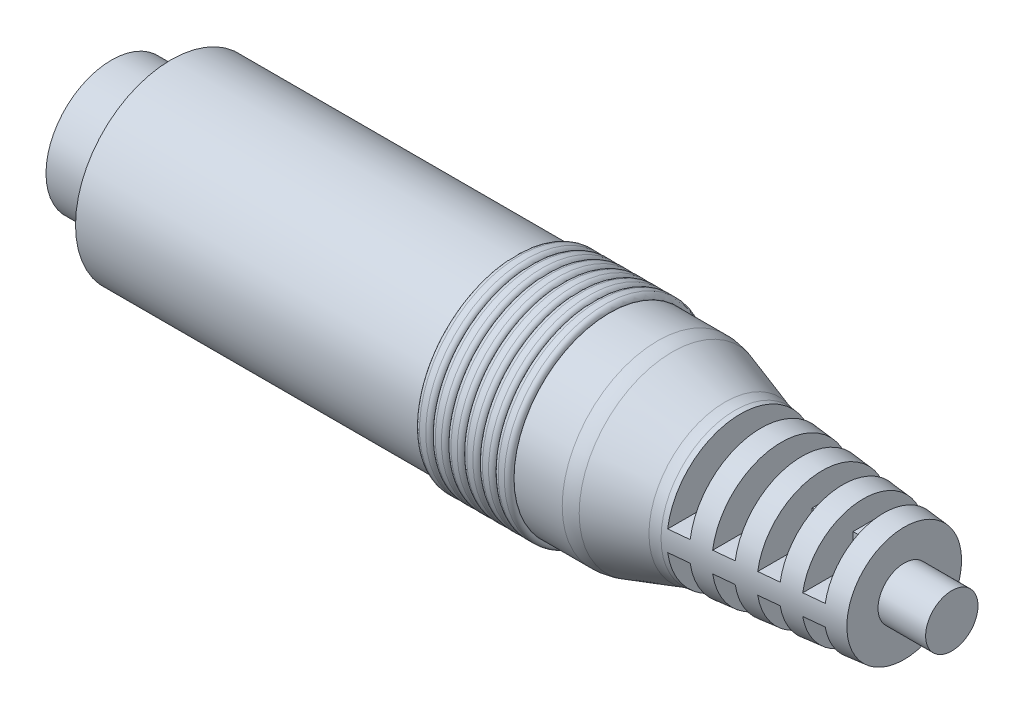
ISO-10303-21;
HEADER;
FILE_DESCRIPTION(('STEP AP214'),'2;1');
FILE_NAME('part.step','',(''),(''),'','','');
FILE_SCHEMA(('AUTOMOTIVE_DESIGN { 1 0 10303 214 1 1 1 1 }'));
ENDSEC;
DATA;
#1=APPLICATION_CONTEXT('core data for automotive mechanical design processes');
#2=APPLICATION_PROTOCOL_DEFINITION('international standard','automotive_design',2000,#1);
#3=PRODUCT_CONTEXT('',#1,'mechanical');
#4=PRODUCT('Part','Part','',(#3));
#5=PRODUCT_RELATED_PRODUCT_CATEGORY('part','',(#4));
#6=PRODUCT_DEFINITION_FORMATION('','',#4);
#7=PRODUCT_DEFINITION_CONTEXT('part definition',#1,'design');
#8=PRODUCT_DEFINITION('design','',#6,#7);
#9=PRODUCT_DEFINITION_SHAPE('','',#8);
#10=(LENGTH_UNIT() NAMED_UNIT(*) SI_UNIT(.MILLI.,.METRE.));
#11=(NAMED_UNIT(*) PLANE_ANGLE_UNIT() SI_UNIT($,.RADIAN.));
#12=(NAMED_UNIT(*) SI_UNIT($,.STERADIAN.) SOLID_ANGLE_UNIT());
#13=UNCERTAINTY_MEASURE_WITH_UNIT(LENGTH_MEASURE(1.E-05),#10,'distance_accuracy_value','');
#14=(GEOMETRIC_REPRESENTATION_CONTEXT(3) GLOBAL_UNCERTAINTY_ASSIGNED_CONTEXT((#13)) GLOBAL_UNIT_ASSIGNED_CONTEXT((#10,
#11,#12)) REPRESENTATION_CONTEXT('',''));
#15=CARTESIAN_POINT('',(0.,0.,0.));
#16=DIRECTION('',(0.,0.,1.));
#17=DIRECTION('',(1.,0.,0.));
#18=AXIS2_PLACEMENT_3D('',#15,#16,#17);
#19=CARTESIAN_POINT('',(-1.16021243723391,0.,0.));
#20=DIRECTION('',(-1.,0.,0.));
#21=DIRECTION('',(0.,0.,1.));
#22=AXIS2_PLACEMENT_3D('',#19,#20,#21);
#23=DEGENERATE_TOROIDAL_SURFACE('',#22,0.0889,0.635,.T.);
#24=CARTESIAN_POINT('',(-1.79521243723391,0.,0.));
#25=DIRECTION('',(-1.,0.,0.));
#26=DIRECTION('',(0.,0.,1.));
#27=AXIS2_PLACEMENT_3D('',#24,#25,#26);
#28=CIRCLE('',#27,0.0889);
#29=CARTESIAN_POINT('',(-1.79521243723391,0.,0.0889));
#30=VERTEX_POINT('',#29);
#31=EDGE_CURVE('E38',#30,#30,#28,.T.);
#32=ORIENTED_EDGE('',*,*,#31,.F.);
#33=EDGE_LOOP('',(#32));
#34=FACE_BOUND('',#33,.T.);
#35=CARTESIAN_POINT('',(-1.16021243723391,0.,0.));
#36=DIRECTION('',(-1.,0.,0.));
#37=DIRECTION('',(0.,0.,1.));
#38=AXIS2_PLACEMENT_3D('',#35,#36,#37);
#39=CIRCLE('',#38,0.7239);
#40=CARTESIAN_POINT('',(-1.16021243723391,0.,0.7239));
#41=VERTEX_POINT('',#40);
#42=EDGE_CURVE('E11',#41,#41,#39,.F.);
#43=ORIENTED_EDGE('',*,*,#42,.F.);
#44=EDGE_LOOP('',(#43));
#45=FACE_BOUND('',#44,.T.);
#46=ADVANCED_FACE('F31',(#34,#45),#23,.T.);
#47=CARTESIAN_POINT('',(6.985,0.,0.));
#48=DIRECTION('',(-1.,0.,0.));
#49=DIRECTION('',(0.,0.,1.));
#50=AXIS2_PLACEMENT_3D('',#47,#48,#49);
#51=PLANE('',#50);
#52=CARTESIAN_POINT('',(6.985,0.,0.));
#53=DIRECTION('',(-1.,0.,0.));
#54=DIRECTION('',(0.,0.,1.));
#55=AXIS2_PLACEMENT_3D('',#52,#53,#54);
#56=CIRCLE('',#55,1.8161);
#57=CARTESIAN_POINT('',(6.985,0.,1.8161));
#58=VERTEX_POINT('',#57);
#59=EDGE_CURVE('E674',#58,#58,#56,.T.);
#60=ORIENTED_EDGE('',*,*,#59,.T.);
#61=EDGE_LOOP('',(#60));
#62=FACE_BOUND('',#61,.T.);
#63=CARTESIAN_POINT('',(6.985,0.,0.));
#64=DIRECTION('',(-1.,0.,0.));
#65=DIRECTION('',(0.,0.,1.));
#66=AXIS2_PLACEMENT_3D('',#63,#64,#65);
#67=CIRCLE('',#66,0.7239);
#68=CARTESIAN_POINT('',(6.985,0.,0.7239));
#69=VERTEX_POINT('',#68);
#70=EDGE_CURVE('E355',#69,#69,#67,.T.);
#71=ORIENTED_EDGE('',*,*,#70,.F.);
#72=EDGE_LOOP('',(#71));
#73=FACE_BOUND('',#72,.T.);
#74=ADVANCED_FACE('F769',(#62,#73),#51,.T.);
#75=CARTESIAN_POINT('',(30.3784,4.35413009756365,-5.3594));
#76=DIRECTION('',(-1.,0.,0.));
#77=DIRECTION('',(0.,0.,1.));
#78=AXIS2_PLACEMENT_3D('',#75,#76,#77);
#79=PLANE('',#78);
#80=DIRECTION('',(0.,-1.,0.));
#81=VECTOR('',#80,1.);
#82=CARTESIAN_POINT('',(30.3784,2.032,-0.5461));
#83=LINE('',#82,#81);
#84=CARTESIAN_POINT('',(30.3784,2.032,-0.5461));
#85=VERTEX_POINT('',#84);
#86=CARTESIAN_POINT('',(30.3784,0.5461,-0.5461));
#87=VERTEX_POINT('',#86);
#88=EDGE_CURVE('E379',#85,#87,#83,.T.);
#89=ORIENTED_EDGE('',*,*,#88,.T.);
#90=DIRECTION('',(0.,0.,1.));
#91=VECTOR('',#90,1.);
#92=CARTESIAN_POINT('',(30.3784,0.5461,-5.3594));
#93=LINE('',#92,#91);
#94=CARTESIAN_POINT('',(30.3784,0.5461,-3.88176801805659));
#95=VERTEX_POINT('',#94);
#96=EDGE_CURVE('E549',#95,#87,#93,.T.);
#97=ORIENTED_EDGE('',*,*,#96,.F.);
#98=CARTESIAN_POINT('',(30.3784,0.,0.));
#99=DIRECTION('',(-1.,0.,0.));
#100=DIRECTION('',(0.,0.,1.));
#101=AXIS2_PLACEMENT_3D('',#98,#99,#100);
#102=CIRCLE('',#101,3.91999338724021);
#103=CARTESIAN_POINT('',(30.3784,0.5461,3.88176801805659));
#104=VERTEX_POINT('',#103);
#105=EDGE_CURVE('E873',#104,#95,#102,.T.);
#106=ORIENTED_EDGE('',*,*,#105,.F.);
#107=CARTESIAN_POINT('',(30.3784,0.5461,0.5461));
#108=VERTEX_POINT('',#107);
#109=EDGE_CURVE('E539',#108,#104,#93,.T.);
#110=ORIENTED_EDGE('',*,*,#109,.F.);
#111=DIRECTION('',(0.,-1.,0.));
#112=VECTOR('',#111,1.);
#113=CARTESIAN_POINT('',(30.3784,2.032,0.5461));
#114=LINE('',#113,#112);
#115=CARTESIAN_POINT('',(30.3784,2.032,0.5461));
#116=VERTEX_POINT('',#115);
#117=EDGE_CURVE('E50',#116,#108,#114,.T.);
#118=ORIENTED_EDGE('',*,*,#117,.F.);
#119=DIRECTION('',(0.,0.,1.));
#120=VECTOR('',#119,1.);
#121=CARTESIAN_POINT('',(30.3784,2.032,0.5461));
#122=LINE('',#121,#120);
#123=EDGE_CURVE('E45',#85,#116,#122,.T.);
#124=ORIENTED_EDGE('',*,*,#123,.F.);
#125=EDGE_LOOP('',(#89,#97,#106,#110,#118,#124));
#126=FACE_BOUND('',#125,.T.);
#127=ADVANCED_FACE('F774',(#126),#79,.F.);
#128=CARTESIAN_POINT('',(31.4706,4.35413009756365,-5.3594));
#129=DIRECTION('',(1.,0.,0.));
#130=DIRECTION('',(0.,0.,-1.));
#131=AXIS2_PLACEMENT_3D('',#128,#129,#130);
#132=PLANE('',#131);
#133=DIRECTION('',(0.,-1.,0.));
#134=VECTOR('',#133,1.);
#135=CARTESIAN_POINT('',(31.4706,2.032,-0.5461));
#136=LINE('',#135,#134);
#137=CARTESIAN_POINT('',(31.4706,2.032,-0.5461));
#138=VERTEX_POINT('',#137);
#139=CARTESIAN_POINT('',(31.4706,0.5461,-0.5461));
#140=VERTEX_POINT('',#139);
#141=EDGE_CURVE('E381',#138,#140,#136,.T.);
#142=ORIENTED_EDGE('',*,*,#141,.F.);
#143=DIRECTION('',(0.,0.,-1.));
#144=VECTOR('',#143,1.);
#145=CARTESIAN_POINT('',(31.4706,2.032,0.5461));
#146=LINE('',#145,#144);
#147=CARTESIAN_POINT('',(31.4706,2.032,0.5461));
#148=VERTEX_POINT('',#147);
#149=EDGE_CURVE('E360',#148,#138,#146,.T.);
#150=ORIENTED_EDGE('',*,*,#149,.F.);
#151=DIRECTION('',(0.,-1.,0.));
#152=VECTOR('',#151,1.);
#153=CARTESIAN_POINT('',(31.4706,2.032,0.5461));
#154=LINE('',#153,#152);
#155=CARTESIAN_POINT('',(31.4706,0.5461,0.5461));
#156=VERTEX_POINT('',#155);
#157=EDGE_CURVE('E374',#148,#156,#154,.T.);
#158=ORIENTED_EDGE('',*,*,#157,.T.);
#159=DIRECTION('',(0.,0.,1.));
#160=VECTOR('',#159,1.);
#161=CARTESIAN_POINT('',(31.4706,0.5461,-5.3594));
#162=LINE('',#161,#160);
#163=CARTESIAN_POINT('',(31.4706,0.5461,3.77324218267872));
#164=VERTEX_POINT('',#163);
#165=EDGE_CURVE('E548',#156,#164,#162,.T.);
#166=ORIENTED_EDGE('',*,*,#165,.T.);
#167=CARTESIAN_POINT('',(31.4706,0.,0.));
#168=DIRECTION('',(1.,0.,0.));
#169=DIRECTION('',(0.,0.,-1.));
#170=AXIS2_PLACEMENT_3D('',#167,#168,#169);
#171=CIRCLE('',#170,3.81255580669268);
#172=CARTESIAN_POINT('',(31.4706,0.5461,-3.77324218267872));
#173=VERTEX_POINT('',#172);
#174=EDGE_CURVE('E1213',#173,#164,#171,.T.);
#175=ORIENTED_EDGE('',*,*,#174,.F.);
#176=EDGE_CURVE('E544',#173,#140,#162,.T.);
#177=ORIENTED_EDGE('',*,*,#176,.T.);
#178=EDGE_LOOP('',(#142,#150,#158,#166,#175,#177));
#179=FACE_BOUND('',#178,.T.);
#180=ADVANCED_FACE('F847',(#179),#132,.F.);
#181=CARTESIAN_POINT('',(30.3784,0.5461,-5.3594));
#182=DIRECTION('',(0.,-1.,0.));
#183=DIRECTION('',(1.,0.,0.));
#184=AXIS2_PLACEMENT_3D('',#181,#182,#183);
#185=PLANE('',#184);
#186=DIRECTION('',(-1.,0.,0.));
#187=VECTOR('',#186,1.);
#188=CARTESIAN_POINT('',(30.3784,0.5461,-0.5461));
#189=LINE('',#188,#187);
#190=EDGE_CURVE('E392',#140,#87,#189,.T.);
#191=ORIENTED_EDGE('',*,*,#190,.F.);
#192=ORIENTED_EDGE('',*,*,#176,.F.);
#193=CARTESIAN_POINT('',(24.0169319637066,0.546100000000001,-4.51283677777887));
#194=CARTESIAN_POINT('',(25.1825059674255,0.5461,-4.3973431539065));
#195=CARTESIAN_POINT('',(26.3480740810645,0.5461,-4.28179003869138));
#196=CARTESIAN_POINT('',(28.6791941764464,0.5461,-4.05052162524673));
#197=CARTESIAN_POINT('',(29.8447461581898,0.5461,-3.93480632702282));
#198=CARTESIAN_POINT('',(32.1758297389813,0.5461,-3.70317033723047));
#199=CARTESIAN_POINT('',(33.3413613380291,0.5461,-3.5872496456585));
#200=CARTESIAN_POINT('',(35.6723965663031,0.546099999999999,-3.35512699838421));
#201=CARTESIAN_POINT('',(36.8379001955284,0.546099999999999,-3.23892504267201));
#202=CARTESIAN_POINT('',(38.0033860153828,0.546099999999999,-3.12254452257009));
#203=B_SPLINE_CURVE_WITH_KNOTS('',3,(#193,#194,#195,#196,#197,#198,#199,#200,#201,#202),
.UNSPECIFIED.,.F.,.F.,(4,2,2,2,4),(0.,3.51384601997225,7.0276919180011,10.5415378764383,
14.0553839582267),.UNSPECIFIED.);
#204=EDGE_CURVE('E866',#95,#173,#203,.T.);
#205=ORIENTED_EDGE('',*,*,#204,.F.);
#206=ORIENTED_EDGE('',*,*,#96,.T.);
#207=EDGE_LOOP('',(#191,#192,#205,#206));
#208=FACE_BOUND('',#207,.T.);
#209=ADVANCED_FACE('F850',(#208),#185,.F.);
#210=DIRECTION('',(1.,0.,0.));
#211=VECTOR('',#210,1.);
#212=CARTESIAN_POINT('',(30.3784,0.5461,0.5461));
#213=LINE('',#212,#211);
#214=EDGE_CURVE('E386',#108,#156,#213,.T.);
#215=ORIENTED_EDGE('',*,*,#214,.F.);
#216=ORIENTED_EDGE('',*,*,#109,.T.);
#217=CARTESIAN_POINT('',(38.0033860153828,0.546099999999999,3.12254452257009));
#218=CARTESIAN_POINT('',(36.0880525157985,0.546099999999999,3.31378690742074));
#219=CARTESIAN_POINT('',(34.1726735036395,0.546099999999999,3.50457242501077));
#220=CARTESIAN_POINT('',(31.8416057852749,0.5461,3.73636845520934));
#221=CARTESIAN_POINT('',(31.4259475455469,0.5461,3.7776852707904));
#222=CARTESIAN_POINT('',(28.6792041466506,0.5461,4.05062233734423));
#223=CARTESIAN_POINT('',(26.3480773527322,0.5461,4.28182378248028));
#224=CARTESIAN_POINT('',(24.0169319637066,0.546100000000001,4.51283677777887));
#225=B_SPLINE_CURVE_WITH_KNOTS('',3,(#217,#218,#219,#220,#221,#222,#223,#224),.UNSPECIFIED.,.F.,
.F.,(4,2,2,4),(0.,5.7745720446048,7.02769201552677,14.0553839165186),.UNSPECIFIED.);
#226=EDGE_CURVE('E859',#164,#104,#225,.T.);
#227=ORIENTED_EDGE('',*,*,#226,.F.);
#228=ORIENTED_EDGE('',*,*,#165,.F.);
#229=EDGE_LOOP('',(#215,#216,#227,#228));
#230=FACE_BOUND('',#229,.T.);
#231=ADVANCED_FACE('F845',(#230),#185,.F.);
#232=CARTESIAN_POINT('',(30.3784,-0.5461,-5.3594));
#233=DIRECTION('',(-1.,0.,0.));
#234=DIRECTION('',(0.,0.,1.));
#235=AXIS2_PLACEMENT_3D('',#232,#233,#234);
#236=PLANE('',#235);
#237=CARTESIAN_POINT('',(30.3784,-0.5461,-0.5461));
#238=VERTEX_POINT('',#237);
#239=CARTESIAN_POINT('',(30.3784,-2.032,-0.5461));
#240=VERTEX_POINT('',#239);
#241=EDGE_CURVE('E378',#238,#240,#83,.T.);
#242=ORIENTED_EDGE('',*,*,#241,.T.);
#243=DIRECTION('',(0.,0.,1.));
#244=VECTOR('',#243,1.);
#245=CARTESIAN_POINT('',(30.3784,-2.032,0.5461));
#246=LINE('',#245,#244);
#247=CARTESIAN_POINT('',(30.3784,-2.032,0.5461));
#248=VERTEX_POINT('',#247);
#249=EDGE_CURVE('E361',#240,#248,#246,.T.);
#250=ORIENTED_EDGE('',*,*,#249,.T.);
#251=CARTESIAN_POINT('',(30.3784,-0.5461,0.5461));
#252=VERTEX_POINT('',#251);
#253=EDGE_CURVE('E359',#252,#248,#114,.T.);
#254=ORIENTED_EDGE('',*,*,#253,.F.);
#255=DIRECTION('',(0.,0.,1.));
#256=VECTOR('',#255,1.);
#257=CARTESIAN_POINT('',(30.3784,-0.5461,-5.3594));
#258=LINE('',#257,#256);
#259=CARTESIAN_POINT('',(30.3784,-0.5461,3.88176801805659));
#260=VERTEX_POINT('',#259);
#261=EDGE_CURVE('E540',#252,#260,#258,.T.);
#262=ORIENTED_EDGE('',*,*,#261,.T.);
#263=CARTESIAN_POINT('',(30.3784,0.,0.));
#264=DIRECTION('',(-1.,0.,0.));
#265=DIRECTION('',(0.,0.,1.));
#266=AXIS2_PLACEMENT_3D('',#263,#264,#265);
#267=CIRCLE('',#266,3.91999338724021);
#268=CARTESIAN_POINT('',(30.3784,-0.5461,-3.88176801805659));
#269=VERTEX_POINT('',#268);
#270=EDGE_CURVE('E814',#269,#260,#267,.T.);
#271=ORIENTED_EDGE('',*,*,#270,.F.);
#272=EDGE_CURVE('E536',#269,#238,#258,.T.);
#273=ORIENTED_EDGE('',*,*,#272,.T.);
#274=EDGE_LOOP('',(#242,#250,#254,#262,#271,#273));
#275=FACE_BOUND('',#274,.T.);
#276=ADVANCED_FACE('F835',(#275),#236,.F.);
#277=CARTESIAN_POINT('',(30.3784,-0.5461,-5.3594));
#278=DIRECTION('',(0.,1.,0.));
#279=DIRECTION('',(0.,0.,1.));
#280=AXIS2_PLACEMENT_3D('',#277,#278,#279);
#281=PLANE('',#280);
#282=DIRECTION('',(1.,0.,0.));
#283=VECTOR('',#282,1.);
#284=CARTESIAN_POINT('',(30.3784,-0.5461,-0.5461));
#285=LINE('',#284,#283);
#286=CARTESIAN_POINT('',(31.4706,-0.5461,-0.5461));
#287=VERTEX_POINT('',#286);
#288=EDGE_CURVE('E389',#238,#287,#285,.T.);
#289=ORIENTED_EDGE('',*,*,#288,.F.);
#290=ORIENTED_EDGE('',*,*,#272,.F.);
#291=CARTESIAN_POINT('',(38.0033860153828,-0.5461,-3.12254452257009));
#292=CARTESIAN_POINT('',(36.0880525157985,-0.5461,-3.31378690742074));
#293=CARTESIAN_POINT('',(34.1726735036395,-0.5461,-3.50457242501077));
#294=CARTESIAN_POINT('',(31.8416057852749,-0.5461,-3.73636845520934));
#295=CARTESIAN_POINT('',(31.4259475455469,-0.5461,-3.7776852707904));
#296=CARTESIAN_POINT('',(28.6792041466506,-0.5461,-4.05062233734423));
#297=CARTESIAN_POINT('',(26.3480773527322,-0.5461,-4.28182378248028));
#298=CARTESIAN_POINT('',(24.0169319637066,-0.5461,-4.51283677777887));
#299=B_SPLINE_CURVE_WITH_KNOTS('',3,(#291,#292,#293,#294,#295,#296,#297,#298),.UNSPECIFIED.,.F.,
.F.,(4,2,2,4),(0.,5.7745720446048,7.02769201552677,14.0553839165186),.UNSPECIFIED.);
#300=CARTESIAN_POINT('',(31.4706,-0.5461,-3.77324218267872));
#301=VERTEX_POINT('',#300);
#302=EDGE_CURVE('E817',#301,#269,#299,.T.);
#303=ORIENTED_EDGE('',*,*,#302,.F.);
#304=DIRECTION('',(0.,0.,1.));
#305=VECTOR('',#304,1.);
#306=CARTESIAN_POINT('',(31.4706,-0.5461,-5.3594));
#307=LINE('',#306,#305);
#308=EDGE_CURVE('E541',#301,#287,#307,.T.);
#309=ORIENTED_EDGE('',*,*,#308,.T.);
#310=EDGE_LOOP('',(#289,#290,#303,#309));
#311=FACE_BOUND('',#310,.T.);
#312=ADVANCED_FACE('F829',(#311),#281,.F.);
#313=DIRECTION('',(-1.,0.,0.));
#314=VECTOR('',#313,1.);
#315=CARTESIAN_POINT('',(30.3784,-0.5461,0.5461));
#316=LINE('',#315,#314);
#317=CARTESIAN_POINT('',(31.4706,-0.5461,0.5461));
#318=VERTEX_POINT('',#317);
#319=EDGE_CURVE('E384',#318,#252,#316,.T.);
#320=ORIENTED_EDGE('',*,*,#319,.F.);
#321=CARTESIAN_POINT('',(31.4706,-0.5461,3.77324218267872));
#322=VERTEX_POINT('',#321);
#323=EDGE_CURVE('E340',#318,#322,#307,.T.);
#324=ORIENTED_EDGE('',*,*,#323,.T.);
#325=CARTESIAN_POINT('',(24.0169319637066,-0.5461,4.51283677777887));
#326=CARTESIAN_POINT('',(25.1825059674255,-0.5461,4.3973431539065));
#327=CARTESIAN_POINT('',(26.3480740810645,-0.5461,4.28179003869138));
#328=CARTESIAN_POINT('',(28.6791941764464,-0.5461,4.05052162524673));
#329=CARTESIAN_POINT('',(29.8447461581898,-0.5461,3.93480632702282));
#330=CARTESIAN_POINT('',(32.1758297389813,-0.5461,3.70317033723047));
#331=CARTESIAN_POINT('',(33.3413613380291,-0.5461,3.5872496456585));
#332=CARTESIAN_POINT('',(35.6723965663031,-0.5461,3.35512699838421));
#333=CARTESIAN_POINT('',(36.8379001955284,-0.5461,3.23892504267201));
#334=CARTESIAN_POINT('',(38.0033860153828,-0.5461,3.12254452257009));
#335=B_SPLINE_CURVE_WITH_KNOTS('',3,(#325,#326,#327,#328,#329,#330,#331,#332,#333,#334),
.UNSPECIFIED.,.F.,.F.,(4,2,2,2,4),(0.,3.51384601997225,7.0276919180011,10.5415378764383,
14.0553839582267),.UNSPECIFIED.);
#336=EDGE_CURVE('E824',#260,#322,#335,.T.);
#337=ORIENTED_EDGE('',*,*,#336,.F.);
#338=ORIENTED_EDGE('',*,*,#261,.F.);
#339=EDGE_LOOP('',(#320,#324,#337,#338));
#340=FACE_BOUND('',#339,.T.);
#341=ADVANCED_FACE('F834',(#340),#281,.F.);
#342=CARTESIAN_POINT('',(31.4706,-0.5461,-5.3594));
#343=DIRECTION('',(1.,0.,0.));
#344=DIRECTION('',(0.,0.,-1.));
#345=AXIS2_PLACEMENT_3D('',#342,#343,#344);
#346=PLANE('',#345);
#347=DIRECTION('',(0.,-1.,0.));
#348=VECTOR('',#347,1.);
#349=CARTESIAN_POINT('',(31.4706,-0.5461,-0.5461));
#350=LINE('',#349,#348);
#351=CARTESIAN_POINT('',(31.4706,-2.032,-0.5461));
#352=VERTEX_POINT('',#351);
#353=EDGE_CURVE('E344',#287,#352,#350,.T.);
#354=ORIENTED_EDGE('',*,*,#353,.F.);
#355=ORIENTED_EDGE('',*,*,#308,.F.);
#356=CARTESIAN_POINT('',(31.4706,0.,0.));
#357=DIRECTION('',(1.,0.,0.));
#358=DIRECTION('',(0.,0.,-1.));
#359=AXIS2_PLACEMENT_3D('',#356,#357,#358);
#360=CIRCLE('',#359,3.81255580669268);
#361=EDGE_CURVE('E872',#322,#301,#360,.T.);
#362=ORIENTED_EDGE('',*,*,#361,.F.);
#363=ORIENTED_EDGE('',*,*,#323,.F.);
#364=DIRECTION('',(0.,1.,0.));
#365=VECTOR('',#364,1.);
#366=CARTESIAN_POINT('',(31.4706,-0.5461,0.5461));
#367=LINE('',#366,#365);
#368=CARTESIAN_POINT('',(31.4706,-2.032,0.5461));
#369=VERTEX_POINT('',#368);
#370=EDGE_CURVE('E334',#369,#318,#367,.T.);
#371=ORIENTED_EDGE('',*,*,#370,.F.);
#372=DIRECTION('',(0.,0.,-1.));
#373=VECTOR('',#372,1.);
#374=CARTESIAN_POINT('',(31.4706,-2.032,0.5461));
#375=LINE('',#374,#373);
#376=EDGE_CURVE('E337',#369,#352,#375,.T.);
#377=ORIENTED_EDGE('',*,*,#376,.T.);
#378=EDGE_LOOP('',(#354,#355,#362,#363,#371,#377));
#379=FACE_BOUND('',#378,.T.);
#380=ADVANCED_FACE('F336',(#379),#346,.F.);
#381=CARTESIAN_POINT('',(32.5628,4.35413009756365,-5.3594));
#382=DIRECTION('',(-1.,0.,0.));
#383=DIRECTION('',(0.,0.,1.));
#384=AXIS2_PLACEMENT_3D('',#381,#382,#383);
#385=PLANE('',#384);
#386=DIRECTION('',(0.,-1.,0.));
#387=VECTOR('',#386,1.);
#388=CARTESIAN_POINT('',(32.5628,2.032,-0.5461));
#389=LINE('',#388,#387);
#390=CARTESIAN_POINT('',(32.5628,2.032,-0.5461));
#391=VERTEX_POINT('',#390);
#392=CARTESIAN_POINT('',(32.5628,0.5461,-0.5461));
#393=VERTEX_POINT('',#392);
#394=EDGE_CURVE('E425',#391,#393,#389,.T.);
#395=ORIENTED_EDGE('',*,*,#394,.T.);
#396=DIRECTION('',(0.,0.,1.));
#397=VECTOR('',#396,1.);
#398=CARTESIAN_POINT('',(32.5628,0.5461,-5.3594));
#399=LINE('',#398,#397);
#400=CARTESIAN_POINT('',(32.5628,0.5461,-3.66465221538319));
#401=VERTEX_POINT('',#400);
#402=EDGE_CURVE('E565',#401,#393,#399,.T.);
#403=ORIENTED_EDGE('',*,*,#402,.F.);
#404=CARTESIAN_POINT('',(32.5628,0.,0.));
#405=DIRECTION('',(-1.,0.,0.));
#406=DIRECTION('',(0.,0.,1.));
#407=AXIS2_PLACEMENT_3D('',#404,#405,#406);
#408=CIRCLE('',#407,3.70511822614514);
#409=CARTESIAN_POINT('',(32.5628,0.5461,3.66465221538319));
#410=VERTEX_POINT('',#409);
#411=EDGE_CURVE('E1248',#410,#401,#408,.T.);
#412=ORIENTED_EDGE('',*,*,#411,.F.);
#413=CARTESIAN_POINT('',(32.5628,0.5461,0.5461));
#414=VERTEX_POINT('',#413);
#415=EDGE_CURVE('E555',#414,#410,#399,.T.);
#416=ORIENTED_EDGE('',*,*,#415,.F.);
#417=DIRECTION('',(0.,-1.,0.));
#418=VECTOR('',#417,1.);
#419=CARTESIAN_POINT('',(32.5628,2.032,0.5461));
#420=LINE('',#419,#418);
#421=CARTESIAN_POINT('',(32.5628,2.032,0.5461));
#422=VERTEX_POINT('',#421);
#423=EDGE_CURVE('E421',#422,#414,#420,.T.);
#424=ORIENTED_EDGE('',*,*,#423,.F.);
#425=DIRECTION('',(0.,0.,1.));
#426=VECTOR('',#425,1.);
#427=CARTESIAN_POINT('',(32.5628,2.032,0.5461));
#428=LINE('',#427,#426);
#429=EDGE_CURVE('E411',#391,#422,#428,.T.);
#430=ORIENTED_EDGE('',*,*,#429,.F.);
#431=EDGE_LOOP('',(#395,#403,#412,#416,#424,#430));
#432=FACE_BOUND('',#431,.T.);
#433=ADVANCED_FACE('F842',(#432),#385,.F.);
#434=CARTESIAN_POINT('',(33.655,4.35413009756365,-5.3594));
#435=DIRECTION('',(1.,0.,0.));
#436=DIRECTION('',(0.,0.,-1.));
#437=AXIS2_PLACEMENT_3D('',#434,#435,#436);
#438=PLANE('',#437);
#439=DIRECTION('',(0.,-1.,0.));
#440=VECTOR('',#439,1.);
#441=CARTESIAN_POINT('',(33.655,2.032,-0.5461));
#442=LINE('',#441,#440);
#443=CARTESIAN_POINT('',(33.655,2.032,-0.5461));
#444=VERTEX_POINT('',#443);
#445=CARTESIAN_POINT('',(33.655,0.5461,-0.5461));
#446=VERTEX_POINT('',#445);
#447=EDGE_CURVE('E427',#444,#446,#442,.T.);
#448=ORIENTED_EDGE('',*,*,#447,.F.);
#449=DIRECTION('',(0.,0.,-1.));
#450=VECTOR('',#449,1.);
#451=CARTESIAN_POINT('',(33.655,2.032,0.5461));
#452=LINE('',#451,#450);
#453=CARTESIAN_POINT('',(33.655,2.032,0.5461));
#454=VERTEX_POINT('',#453);
#455=EDGE_CURVE('E405',#454,#444,#452,.T.);
#456=ORIENTED_EDGE('',*,*,#455,.F.);
#457=DIRECTION('',(0.,-1.,0.));
#458=VECTOR('',#457,1.);
#459=CARTESIAN_POINT('',(33.655,2.032,0.5461));
#460=LINE('',#459,#458);
#461=CARTESIAN_POINT('',(33.655,0.5461,0.5461));
#462=VERTEX_POINT('',#461);
#463=EDGE_CURVE('E417',#454,#462,#460,.T.);
#464=ORIENTED_EDGE('',*,*,#463,.T.);
#465=DIRECTION('',(0.,0.,1.));
#466=VECTOR('',#465,1.);
#467=CARTESIAN_POINT('',(33.655,0.5461,-5.3594));
#468=LINE('',#467,#466);
#469=CARTESIAN_POINT('',(33.655,0.5461,3.55599224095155));
#470=VERTEX_POINT('',#469);
#471=EDGE_CURVE('E564',#462,#470,#468,.T.);
#472=ORIENTED_EDGE('',*,*,#471,.T.);
#473=CARTESIAN_POINT('',(33.655,0.,0.));
#474=DIRECTION('',(1.,0.,0.));
#475=DIRECTION('',(0.,0.,-1.));
#476=AXIS2_PLACEMENT_3D('',#473,#474,#475);
#477=CIRCLE('',#476,3.59768064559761);
#478=CARTESIAN_POINT('',(33.655,0.5461,-3.55599224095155));
#479=VERTEX_POINT('',#478);
#480=EDGE_CURVE('E1302',#479,#470,#477,.T.);
#481=ORIENTED_EDGE('',*,*,#480,.F.);
#482=EDGE_CURVE('E560',#479,#446,#468,.T.);
#483=ORIENTED_EDGE('',*,*,#482,.T.);
#484=EDGE_LOOP('',(#448,#456,#464,#472,#481,#483));
#485=FACE_BOUND('',#484,.T.);
#486=ADVANCED_FACE('F898',(#485),#438,.F.);
#487=CARTESIAN_POINT('',(32.5628,0.5461,-5.3594));
#488=DIRECTION('',(0.,-1.,0.));
#489=DIRECTION('',(1.,0.,0.));
#490=AXIS2_PLACEMENT_3D('',#487,#488,#489);
#491=PLANE('',#490);
#492=DIRECTION('',(-1.,0.,0.));
#493=VECTOR('',#492,1.);
#494=CARTESIAN_POINT('',(32.5628,0.5461,-0.5461));
#495=LINE('',#494,#493);
#496=EDGE_CURVE('E439',#446,#393,#495,.T.);
#497=ORIENTED_EDGE('',*,*,#496,.F.);
#498=ORIENTED_EDGE('',*,*,#482,.F.);
#499=CARTESIAN_POINT('',(26.5655852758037,0.5461,-4.26019377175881));
#500=CARTESIAN_POINT('',(27.6668682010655,0.5461,-4.15097422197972));
#501=CARTESIAN_POINT('',(28.7681448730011,0.5461,-4.04169156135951));
#502=CARTESIAN_POINT('',(30.9706810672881,0.5461,-3.82295405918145));
#503=CARTESIAN_POINT('',(32.0719405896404,0.5461,-3.71349921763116));
#504=CARTESIAN_POINT('',(34.2744379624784,0.5461,-3.49437138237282));
#505=CARTESIAN_POINT('',(35.3756758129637,0.5461,-3.38469838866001));
#506=CARTESIAN_POINT('',(37.5781217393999,0.546099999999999,-3.16505338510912));
#507=CARTESIAN_POINT('',(38.6793298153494,0.546099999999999,-3.05508137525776));
#508=CARTESIAN_POINT('',(39.7805189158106,0.546099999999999,-2.94491942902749));
#509=B_SPLINE_CURVE_WITH_KNOTS('',3,(#499,#500,#501,#502,#503,#504,#505,#506,#507,#508),
.UNSPECIFIED.,.F.,.F.,(4,2,2,2,4),(0.,3.32005677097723,6.64011339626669,9.96017009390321,
13.2802269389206),.UNSPECIFIED.);
#510=EDGE_CURVE('E1241',#401,#479,#509,.T.);
#511=ORIENTED_EDGE('',*,*,#510,.F.);
#512=ORIENTED_EDGE('',*,*,#402,.T.);
#513=EDGE_LOOP('',(#497,#498,#511,#512));
#514=FACE_BOUND('',#513,.T.);
#515=ADVANCED_FACE('F906',(#514),#491,.F.);
#516=DIRECTION('',(1.,0.,0.));
#517=VECTOR('',#516,1.);
#518=CARTESIAN_POINT('',(32.5628,0.5461,0.5461));
#519=LINE('',#518,#517);
#520=EDGE_CURVE('E433',#414,#462,#519,.T.);
#521=ORIENTED_EDGE('',*,*,#520,.F.);
#522=ORIENTED_EDGE('',*,*,#415,.T.);
#523=CARTESIAN_POINT('',(39.7805189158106,0.546099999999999,2.94491942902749));
#524=CARTESIAN_POINT('',(37.9708432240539,0.546099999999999,3.12594193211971));
#525=CARTESIAN_POINT('',(36.1611190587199,0.546099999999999,3.30647859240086));
#526=CARTESIAN_POINT('',(33.958638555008,0.5461,3.52577646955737));
#527=CARTESIAN_POINT('',(33.5659146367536,0.5461,3.56486319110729));
#528=CARTESIAN_POINT('',(30.9706916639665,0.5461,3.82306101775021));
#529=CARTESIAN_POINT('',(28.7681483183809,0.5461,4.04172716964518));
#530=CARTESIAN_POINT('',(26.5655852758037,0.5461,4.26019377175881));
#531=B_SPLINE_CURVE_WITH_KNOTS('',3,(#523,#524,#525,#526,#527,#528,#529,#530),.UNSPECIFIED.,.F.,
.F.,(4,2,2,4),(0.,5.45612084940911,6.64011351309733,13.2802268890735),.UNSPECIFIED.);
#532=EDGE_CURVE('E1234',#470,#410,#531,.T.);
#533=ORIENTED_EDGE('',*,*,#532,.F.);
#534=ORIENTED_EDGE('',*,*,#471,.F.);
#535=EDGE_LOOP('',(#521,#522,#533,#534));
#536=FACE_BOUND('',#535,.T.);
#537=ADVANCED_FACE('F914',(#536),#491,.F.);
#538=CARTESIAN_POINT('',(32.5628,-0.5461,-5.3594));
#539=DIRECTION('',(-1.,0.,0.));
#540=DIRECTION('',(0.,0.,1.));
#541=AXIS2_PLACEMENT_3D('',#538,#539,#540);
#542=PLANE('',#541);
#543=CARTESIAN_POINT('',(32.5628,-0.5461,-0.5461));
#544=VERTEX_POINT('',#543);
#545=CARTESIAN_POINT('',(32.5628,-2.032,-0.5461));
#546=VERTEX_POINT('',#545);
#547=EDGE_CURVE('E424',#544,#546,#389,.T.);
#548=ORIENTED_EDGE('',*,*,#547,.T.);
#549=DIRECTION('',(0.,0.,1.));
#550=VECTOR('',#549,1.);
#551=CARTESIAN_POINT('',(32.5628,-2.032,0.5461));
#552=LINE('',#551,#550);
#553=CARTESIAN_POINT('',(32.5628,-2.032,0.5461));
#554=VERTEX_POINT('',#553);
#555=EDGE_CURVE('E400',#546,#554,#552,.T.);
#556=ORIENTED_EDGE('',*,*,#555,.T.);
#557=CARTESIAN_POINT('',(32.5628,-0.5461,0.5461));
#558=VERTEX_POINT('',#557);
#559=EDGE_CURVE('E420',#558,#554,#420,.T.);
#560=ORIENTED_EDGE('',*,*,#559,.F.);
#561=DIRECTION('',(0.,0.,1.));
#562=VECTOR('',#561,1.);
#563=CARTESIAN_POINT('',(32.5628,-0.5461,-5.3594));
#564=LINE('',#563,#562);
#565=CARTESIAN_POINT('',(32.5628,-0.5461,3.66465221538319));
#566=VERTEX_POINT('',#565);
#567=EDGE_CURVE('E556',#558,#566,#564,.T.);
#568=ORIENTED_EDGE('',*,*,#567,.T.);
#569=CARTESIAN_POINT('',(32.5628,0.,0.));
#570=DIRECTION('',(-1.,0.,0.));
#571=DIRECTION('',(0.,0.,1.));
#572=AXIS2_PLACEMENT_3D('',#569,#570,#571);
#573=CIRCLE('',#572,3.70511822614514);
#574=CARTESIAN_POINT('',(32.5628,-0.5461,-3.66465221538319));
#575=VERTEX_POINT('',#574);
#576=EDGE_CURVE('E1214',#575,#566,#573,.T.);
#577=ORIENTED_EDGE('',*,*,#576,.F.);
#578=EDGE_CURVE('E552',#575,#544,#564,.T.);
#579=ORIENTED_EDGE('',*,*,#578,.T.);
#580=EDGE_LOOP('',(#548,#556,#560,#568,#577,#579));
#581=FACE_BOUND('',#580,.T.);
#582=ADVANCED_FACE('F922',(#581),#542,.F.);
#583=CARTESIAN_POINT('',(32.5628,-0.5461,-5.3594));
#584=DIRECTION('',(0.,1.,0.));
#585=DIRECTION('',(0.,0.,1.));
#586=AXIS2_PLACEMENT_3D('',#583,#584,#585);
#587=PLANE('',#586);
#588=DIRECTION('',(1.,0.,0.));
#589=VECTOR('',#588,1.);
#590=CARTESIAN_POINT('',(32.5628,-0.5461,-0.5461));
#591=LINE('',#590,#589);
#592=CARTESIAN_POINT('',(33.655,-0.5461,-0.5461));
#593=VERTEX_POINT('',#592);
#594=EDGE_CURVE('E436',#544,#593,#591,.T.);
#595=ORIENTED_EDGE('',*,*,#594,.F.);
#596=ORIENTED_EDGE('',*,*,#578,.F.);
#597=CARTESIAN_POINT('',(39.7805189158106,-0.5461,-2.94491942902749));
#598=CARTESIAN_POINT('',(37.9708432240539,-0.5461,-3.12594193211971));
#599=CARTESIAN_POINT('',(36.1611190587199,-0.5461,-3.30647859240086));
#600=CARTESIAN_POINT('',(33.958638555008,-0.5461,-3.52577646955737));
#601=CARTESIAN_POINT('',(33.5659146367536,-0.5461,-3.56486319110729));
#602=CARTESIAN_POINT('',(30.9706916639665,-0.5461,-3.82306101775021));
#603=CARTESIAN_POINT('',(28.7681483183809,-0.5461,-4.04172716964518));
#604=CARTESIAN_POINT('',(26.5655852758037,-0.5461,-4.26019377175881));
#605=B_SPLINE_CURVE_WITH_KNOTS('',3,(#597,#598,#599,#600,#601,#602,#603,#604),.UNSPECIFIED.,.F.,
.F.,(4,2,2,4),(0.,5.45612084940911,6.64011351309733,13.2802268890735),.UNSPECIFIED.);
#606=CARTESIAN_POINT('',(33.655,-0.5461,-3.55599224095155));
#607=VERTEX_POINT('',#606);
#608=EDGE_CURVE('E1216',#607,#575,#605,.T.);
#609=ORIENTED_EDGE('',*,*,#608,.F.);
#610=DIRECTION('',(0.,0.,1.));
#611=VECTOR('',#610,1.);
#612=CARTESIAN_POINT('',(33.655,-0.5461,-5.3594));
#613=LINE('',#612,#611);
#614=EDGE_CURVE('E557',#607,#593,#613,.T.);
#615=ORIENTED_EDGE('',*,*,#614,.T.);
#616=EDGE_LOOP('',(#595,#596,#609,#615));
#617=FACE_BOUND('',#616,.T.);
#618=ADVANCED_FACE('F929',(#617),#587,.F.);
#619=DIRECTION('',(-1.,0.,0.));
#620=VECTOR('',#619,1.);
#621=CARTESIAN_POINT('',(32.5628,-0.5461,0.5461));
#622=LINE('',#621,#620);
#623=CARTESIAN_POINT('',(33.655,-0.5461,0.5461));
#624=VERTEX_POINT('',#623);
#625=EDGE_CURVE('E430',#624,#558,#622,.T.);
#626=ORIENTED_EDGE('',*,*,#625,.F.);
#627=CARTESIAN_POINT('',(33.655,-0.5461,3.55599224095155));
#628=VERTEX_POINT('',#627);
#629=EDGE_CURVE('E547',#624,#628,#613,.T.);
#630=ORIENTED_EDGE('',*,*,#629,.T.);
#631=CARTESIAN_POINT('',(26.5655852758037,-0.5461,4.26019377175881));
#632=CARTESIAN_POINT('',(27.6668682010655,-0.5461,4.15097422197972));
#633=CARTESIAN_POINT('',(28.7681448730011,-0.5461,4.04169156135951));
#634=CARTESIAN_POINT('',(30.9706810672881,-0.5461,3.82295405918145));
#635=CARTESIAN_POINT('',(32.0719405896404,-0.5461,3.71349921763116));
#636=CARTESIAN_POINT('',(34.2744379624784,-0.5461,3.49437138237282));
#637=CARTESIAN_POINT('',(35.3756758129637,-0.5461,3.38469838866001));
#638=CARTESIAN_POINT('',(37.5781217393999,-0.5461,3.16505338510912));
#639=CARTESIAN_POINT('',(38.6793298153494,-0.5461,3.05508137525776));
#640=CARTESIAN_POINT('',(39.7805189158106,-0.5461,2.94491942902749));
#641=B_SPLINE_CURVE_WITH_KNOTS('',3,(#631,#632,#633,#634,#635,#636,#637,#638,#639,#640),
.UNSPECIFIED.,.F.,.F.,(4,2,2,2,4),(0.,3.32005677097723,6.64011339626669,9.96017009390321,
13.2802269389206),.UNSPECIFIED.);
#642=EDGE_CURVE('E1219',#566,#628,#641,.T.);
#643=ORIENTED_EDGE('',*,*,#642,.F.);
#644=ORIENTED_EDGE('',*,*,#567,.F.);
#645=EDGE_LOOP('',(#626,#630,#643,#644));
#646=FACE_BOUND('',#645,.T.);
#647=ADVANCED_FACE('F937',(#646),#587,.F.);
#648=CARTESIAN_POINT('',(33.655,-0.5461,-5.3594));
#649=DIRECTION('',(1.,0.,0.));
#650=DIRECTION('',(0.,0.,-1.));
#651=AXIS2_PLACEMENT_3D('',#648,#649,#650);
#652=PLANE('',#651);
#653=DIRECTION('',(0.,-1.,0.));
#654=VECTOR('',#653,1.);
#655=CARTESIAN_POINT('',(33.655,-0.5461,-0.5461));
#656=LINE('',#655,#654);
#657=CARTESIAN_POINT('',(33.655,-2.032,-0.5461));
#658=VERTEX_POINT('',#657);
#659=EDGE_CURVE('E345',#593,#658,#656,.T.);
#660=ORIENTED_EDGE('',*,*,#659,.F.);
#661=ORIENTED_EDGE('',*,*,#614,.F.);
#662=CARTESIAN_POINT('',(33.655,0.,0.));
#663=DIRECTION('',(1.,0.,0.));
#664=DIRECTION('',(0.,0.,-1.));
#665=AXIS2_PLACEMENT_3D('',#662,#663,#664);
#666=CIRCLE('',#665,3.59768064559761);
#667=EDGE_CURVE('E1247',#628,#607,#666,.T.);
#668=ORIENTED_EDGE('',*,*,#667,.F.);
#669=ORIENTED_EDGE('',*,*,#629,.F.);
#670=DIRECTION('',(0.,1.,0.));
#671=VECTOR('',#670,1.);
#672=CARTESIAN_POINT('',(33.655,-0.5461,0.5461));
#673=LINE('',#672,#671);
#674=CARTESIAN_POINT('',(33.655,-2.032,0.5461));
#675=VERTEX_POINT('',#674);
#676=EDGE_CURVE('E799',#675,#624,#673,.T.);
#677=ORIENTED_EDGE('',*,*,#676,.F.);
#678=DIRECTION('',(0.,0.,-1.));
#679=VECTOR('',#678,1.);
#680=CARTESIAN_POINT('',(33.655,-2.032,0.5461));
#681=LINE('',#680,#679);
#682=EDGE_CURVE('E395',#675,#658,#681,.T.);
#683=ORIENTED_EDGE('',*,*,#682,.T.);
#684=EDGE_LOOP('',(#660,#661,#668,#669,#677,#683));
#685=FACE_BOUND('',#684,.T.);
#686=ADVANCED_FACE('F944',(#685),#652,.F.);
#687=CARTESIAN_POINT('',(34.7472,4.35413009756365,-5.3594));
#688=DIRECTION('',(-1.,0.,0.));
#689=DIRECTION('',(0.,0.,1.));
#690=AXIS2_PLACEMENT_3D('',#687,#688,#689);
#691=PLANE('',#690);
#692=DIRECTION('',(0.,-1.,0.));
#693=VECTOR('',#692,1.);
#694=CARTESIAN_POINT('',(34.7472,2.032,-0.5461));
#695=LINE('',#694,#693);
#696=CARTESIAN_POINT('',(34.7472,2.032,-0.5461));
#697=VERTEX_POINT('',#696);
#698=CARTESIAN_POINT('',(34.7472,0.5461,-0.5461));
#699=VERTEX_POINT('',#698);
#700=EDGE_CURVE('E472',#697,#699,#695,.T.);
#701=ORIENTED_EDGE('',*,*,#700,.T.);
#702=DIRECTION('',(0.,0.,1.));
#703=VECTOR('',#702,1.);
#704=CARTESIAN_POINT('',(34.7472,0.5461,-5.3594));
#705=LINE('',#704,#703);
#706=CARTESIAN_POINT('',(34.7472,0.5461,-3.44725563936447));
#707=VERTEX_POINT('',#706);
#708=EDGE_CURVE('E581',#707,#699,#705,.T.);
#709=ORIENTED_EDGE('',*,*,#708,.F.);
#710=CARTESIAN_POINT('',(34.7472,0.,0.));
#711=DIRECTION('',(-1.,0.,0.));
#712=DIRECTION('',(0.,0.,1.));
#713=AXIS2_PLACEMENT_3D('',#710,#711,#712);
#714=CIRCLE('',#713,3.49024306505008);
#715=CARTESIAN_POINT('',(34.7472,0.5461,3.44725563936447));
#716=VERTEX_POINT('',#715);
#717=EDGE_CURVE('E1337',#716,#707,#714,.T.);
#718=ORIENTED_EDGE('',*,*,#717,.F.);
#719=CARTESIAN_POINT('',(34.7472,0.5461,0.5461));
#720=VERTEX_POINT('',#719);
#721=EDGE_CURVE('E571',#720,#716,#705,.T.);
#722=ORIENTED_EDGE('',*,*,#721,.F.);
#723=DIRECTION('',(0.,-1.,0.));
#724=VECTOR('',#723,1.);
#725=CARTESIAN_POINT('',(34.7472,2.032,0.5461));
#726=LINE('',#725,#724);
#727=CARTESIAN_POINT('',(34.7472,2.032,0.5461));
#728=VERTEX_POINT('',#727);
#729=EDGE_CURVE('E468',#728,#720,#726,.T.);
#730=ORIENTED_EDGE('',*,*,#729,.F.);
#731=DIRECTION('',(0.,0.,1.));
#732=VECTOR('',#731,1.);
#733=CARTESIAN_POINT('',(34.7472,2.032,0.5461));
#734=LINE('',#733,#732);
#735=EDGE_CURVE('E458',#697,#728,#734,.T.);
#736=ORIENTED_EDGE('',*,*,#735,.F.);
#737=EDGE_LOOP('',(#701,#709,#718,#722,#730,#736));
#738=FACE_BOUND('',#737,.T.);
#739=ADVANCED_FACE('F755',(#738),#691,.F.);
#740=CARTESIAN_POINT('',(35.8394,4.35413009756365,-5.3594));
#741=DIRECTION('',(1.,0.,0.));
#742=DIRECTION('',(0.,0.,-1.));
#743=AXIS2_PLACEMENT_3D('',#740,#741,#742);
#744=PLANE('',#743);
#745=DIRECTION('',(0.,-1.,0.));
#746=VECTOR('',#745,1.);
#747=CARTESIAN_POINT('',(35.8394,2.032,-0.5461));
#748=LINE('',#747,#746);
#749=CARTESIAN_POINT('',(35.8394,2.032,-0.5461));
#750=VERTEX_POINT('',#749);
#751=CARTESIAN_POINT('',(35.8394,0.5461,-0.5461));
#752=VERTEX_POINT('',#751);
#753=EDGE_CURVE('E474',#750,#752,#748,.T.);
#754=ORIENTED_EDGE('',*,*,#753,.F.);
#755=DIRECTION('',(0.,0.,-1.));
#756=VECTOR('',#755,1.);
#757=CARTESIAN_POINT('',(35.8394,2.032,0.5461));
#758=LINE('',#757,#756);
#759=CARTESIAN_POINT('',(35.8394,2.032,0.5461));
#760=VERTEX_POINT('',#759);
#761=EDGE_CURVE('E452',#760,#750,#758,.T.);
#762=ORIENTED_EDGE('',*,*,#761,.F.);
#763=DIRECTION('',(0.,-1.,0.));
#764=VECTOR('',#763,1.);
#765=CARTESIAN_POINT('',(35.8394,2.032,0.5461));
#766=LINE('',#765,#764);
#767=CARTESIAN_POINT('',(35.8394,0.5461,0.5461));
#768=VERTEX_POINT('',#767);
#769=EDGE_CURVE('E464',#760,#768,#766,.T.);
#770=ORIENTED_EDGE('',*,*,#769,.T.);
#771=DIRECTION('',(0.,0.,1.));
#772=VECTOR('',#771,1.);
#773=CARTESIAN_POINT('',(35.8394,0.5461,-5.3594));
#774=LINE('',#773,#772);
#775=CARTESIAN_POINT('',(35.8394,0.5461,3.33843492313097));
#776=VERTEX_POINT('',#775);
#777=EDGE_CURVE('E580',#768,#776,#774,.T.);
#778=ORIENTED_EDGE('',*,*,#777,.T.);
#779=CARTESIAN_POINT('',(35.8394,0.,0.));
#780=DIRECTION('',(1.,0.,0.));
#781=DIRECTION('',(0.,0.,-1.));
#782=AXIS2_PLACEMENT_3D('',#779,#780,#781);
#783=CIRCLE('',#782,3.38280548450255);
#784=CARTESIAN_POINT('',(35.8394,0.5461,-3.33843492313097));
#785=VERTEX_POINT('',#784);
#786=EDGE_CURVE('E1387',#785,#776,#783,.T.);
#787=ORIENTED_EDGE('',*,*,#786,.F.);
#788=EDGE_CURVE('E576',#785,#752,#774,.T.);
#789=ORIENTED_EDGE('',*,*,#788,.T.);
#790=EDGE_LOOP('',(#754,#762,#770,#778,#787,#789));
#791=FACE_BOUND('',#790,.T.);
#792=ADVANCED_FACE('F958',(#791),#744,.F.);
#793=CARTESIAN_POINT('',(34.7472,0.5461,-5.3594));
#794=DIRECTION('',(0.,-1.,0.));
#795=DIRECTION('',(1.,0.,0.));
#796=AXIS2_PLACEMENT_3D('',#793,#794,#795);
#797=PLANE('',#796);
#798=DIRECTION('',(-1.,0.,0.));
#799=VECTOR('',#798,1.);
#800=CARTESIAN_POINT('',(34.7472,0.5461,-0.5461));
#801=LINE('',#800,#799);
#802=EDGE_CURVE('E486',#752,#699,#801,.T.);
#803=ORIENTED_EDGE('',*,*,#802,.F.);
#804=ORIENTED_EDGE('',*,*,#788,.F.);
#805=CARTESIAN_POINT('',(29.1142034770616,0.5461,-4.00731096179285));
#806=CARTESIAN_POINT('',(30.1511956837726,0.5461,-3.90435899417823));
#807=CARTESIAN_POINT('',(31.1881812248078,0.5461,-3.80133981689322));
#808=CARTESIAN_POINT('',(33.2621339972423,0.5461,-3.59511793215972));
#809=CARTESIAN_POINT('',(34.2991012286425,0.5461,-3.49191522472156));
#810=CARTESIAN_POINT('',(36.3730125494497,0.5461,-3.28527715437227));
#811=CARTESIAN_POINT('',(37.4099566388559,0.5461,-3.1818417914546));
#812=CARTESIAN_POINT('',(39.4838129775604,0.546099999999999,-2.97465181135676));
#813=CARTESIAN_POINT('',(40.5207252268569,0.546099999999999,-2.87089719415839));
#814=CARTESIAN_POINT('',(41.5576171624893,0.546099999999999,-2.76693965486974));
#815=B_SPLINE_CURVE_WITH_KNOTS('',3,(#805,#806,#807,#808,#809,#810,#811,#812,#813,#814),
.UNSPECIFIED.,.F.,.F.,(4,2,2,2,4),(0.,3.12627054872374,6.25254092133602,9.37881138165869,
12.5050820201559),.UNSPECIFIED.);
#816=EDGE_CURVE('E1330',#707,#785,#815,.T.);
#817=ORIENTED_EDGE('',*,*,#816,.F.);
#818=ORIENTED_EDGE('',*,*,#708,.T.);
#819=EDGE_LOOP('',(#803,#804,#817,#818));
#820=FACE_BOUND('',#819,.T.);
#821=ADVANCED_FACE('F965',(#820),#797,.F.);
#822=DIRECTION('',(1.,0.,0.));
#823=VECTOR('',#822,1.);
#824=CARTESIAN_POINT('',(34.7472,0.5461,0.5461));
#825=LINE('',#824,#823);
#826=EDGE_CURVE('E480',#720,#768,#825,.T.);
#827=ORIENTED_EDGE('',*,*,#826,.F.);
#828=ORIENTED_EDGE('',*,*,#721,.T.);
#829=CARTESIAN_POINT('',(41.5576171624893,0.546099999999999,2.76693965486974));
#830=CARTESIAN_POINT('',(39.8535995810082,0.546099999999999,2.93776544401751));
#831=CARTESIAN_POINT('',(38.1495301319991,0.546099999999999,3.10807232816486));
#832=CARTESIAN_POINT('',(36.0756368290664,0.5461,3.31489182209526));
#833=CARTESIAN_POINT('',(35.7058476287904,0.5461,3.35175180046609));
#834=CARTESIAN_POINT('',(33.2621453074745,0.5461,3.59523198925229));
#835=CARTESIAN_POINT('',(31.188184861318,0.5461,3.80137749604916));
#836=CARTESIAN_POINT('',(29.1142034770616,0.5461,4.00731096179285));
#837=B_SPLINE_CURVE_WITH_KNOTS('',3,(#829,#830,#831,#832,#833,#834,#835,#836),.UNSPECIFIED.,.F.,
.F.,(4,2,2,4),(0.,5.13767587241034,6.25254106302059,12.5050819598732),.UNSPECIFIED.);
#838=EDGE_CURVE('E1324',#776,#716,#837,.T.);
#839=ORIENTED_EDGE('',*,*,#838,.F.);
#840=ORIENTED_EDGE('',*,*,#777,.F.);
#841=EDGE_LOOP('',(#827,#828,#839,#840));
#842=FACE_BOUND('',#841,.T.);
#843=ADVANCED_FACE('F973',(#842),#797,.F.);
#844=CARTESIAN_POINT('',(34.7472,-0.5461,-5.3594));
#845=DIRECTION('',(-1.,0.,0.));
#846=DIRECTION('',(0.,0.,1.));
#847=AXIS2_PLACEMENT_3D('',#844,#845,#846);
#848=PLANE('',#847);
#849=CARTESIAN_POINT('',(34.7472,-0.5461,-0.5461));
#850=VERTEX_POINT('',#849);
#851=CARTESIAN_POINT('',(34.7472,-2.032,-0.5461));
#852=VERTEX_POINT('',#851);
#853=EDGE_CURVE('E471',#850,#852,#695,.T.);
#854=ORIENTED_EDGE('',*,*,#853,.T.);
#855=DIRECTION('',(0.,0.,1.));
#856=VECTOR('',#855,1.);
#857=CARTESIAN_POINT('',(34.7472,-2.032,0.5461));
#858=LINE('',#857,#856);
#859=CARTESIAN_POINT('',(34.7472,-2.032,0.5461));
#860=VERTEX_POINT('',#859);
#861=EDGE_CURVE('E447',#852,#860,#858,.T.);
#862=ORIENTED_EDGE('',*,*,#861,.T.);
#863=CARTESIAN_POINT('',(34.7472,-0.5461,0.5461));
#864=VERTEX_POINT('',#863);
#865=EDGE_CURVE('E467',#864,#860,#726,.T.);
#866=ORIENTED_EDGE('',*,*,#865,.F.);
#867=DIRECTION('',(0.,0.,1.));
#868=VECTOR('',#867,1.);
#869=CARTESIAN_POINT('',(34.7472,-0.5461,-5.3594));
#870=LINE('',#869,#868);
#871=CARTESIAN_POINT('',(34.7472,-0.5461,3.44725563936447));
#872=VERTEX_POINT('',#871);
#873=EDGE_CURVE('E572',#864,#872,#870,.T.);
#874=ORIENTED_EDGE('',*,*,#873,.T.);
#875=CARTESIAN_POINT('',(34.7472,0.,0.));
#876=DIRECTION('',(-1.,0.,0.));
#877=DIRECTION('',(0.,0.,1.));
#878=AXIS2_PLACEMENT_3D('',#875,#876,#877);
#879=CIRCLE('',#878,3.49024306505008);
#880=CARTESIAN_POINT('',(34.7472,-0.5461,-3.44725563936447));
#881=VERTEX_POINT('',#880);
#882=EDGE_CURVE('E1304',#881,#872,#879,.T.);
#883=ORIENTED_EDGE('',*,*,#882,.F.);
#884=EDGE_CURVE('E568',#881,#850,#870,.T.);
#885=ORIENTED_EDGE('',*,*,#884,.T.);
#886=EDGE_LOOP('',(#854,#862,#866,#874,#883,#885));
#887=FACE_BOUND('',#886,.T.);
#888=ADVANCED_FACE('F980',(#887),#848,.F.);
#889=CARTESIAN_POINT('',(34.7472,-0.5461,-5.3594));
#890=DIRECTION('',(0.,1.,0.));
#891=DIRECTION('',(0.,0.,1.));
#892=AXIS2_PLACEMENT_3D('',#889,#890,#891);
#893=PLANE('',#892);
#894=DIRECTION('',(1.,0.,0.));
#895=VECTOR('',#894,1.);
#896=CARTESIAN_POINT('',(34.7472,-0.5461,-0.5461));
#897=LINE('',#896,#895);
#898=CARTESIAN_POINT('',(35.8394,-0.5461,-0.5461));
#899=VERTEX_POINT('',#898);
#900=EDGE_CURVE('E483',#850,#899,#897,.T.);
#901=ORIENTED_EDGE('',*,*,#900,.F.);
#902=ORIENTED_EDGE('',*,*,#884,.F.);
#903=CARTESIAN_POINT('',(41.5576171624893,-0.5461,-2.76693965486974));
#904=CARTESIAN_POINT('',(39.8535995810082,-0.5461,-2.93776544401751));
#905=CARTESIAN_POINT('',(38.1495301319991,-0.5461,-3.10807232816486));
#906=CARTESIAN_POINT('',(36.0756368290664,-0.5461,-3.31489182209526));
#907=CARTESIAN_POINT('',(35.7058476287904,-0.5461,-3.35175180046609));
#908=CARTESIAN_POINT('',(33.2621453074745,-0.5461,-3.59523198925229));
#909=CARTESIAN_POINT('',(31.188184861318,-0.5461,-3.80137749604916));
#910=CARTESIAN_POINT('',(29.1142034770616,-0.5461,-4.00731096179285));
#911=B_SPLINE_CURVE_WITH_KNOTS('',3,(#903,#904,#905,#906,#907,#908,#909,#910),.UNSPECIFIED.,.F.,
.F.,(4,2,2,4),(0.,5.13767587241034,6.25254106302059,12.5050819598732),.UNSPECIFIED.);
#912=CARTESIAN_POINT('',(35.8394,-0.5461,-3.33843492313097));
#913=VERTEX_POINT('',#912);
#914=EDGE_CURVE('E1306',#913,#881,#911,.T.);
#915=ORIENTED_EDGE('',*,*,#914,.F.);
#916=DIRECTION('',(0.,0.,1.));
#917=VECTOR('',#916,1.);
#918=CARTESIAN_POINT('',(35.8394,-0.5461,-5.3594));
#919=LINE('',#918,#917);
#920=EDGE_CURVE('E573',#913,#899,#919,.T.);
#921=ORIENTED_EDGE('',*,*,#920,.T.);
#922=EDGE_LOOP('',(#901,#902,#915,#921));
#923=FACE_BOUND('',#922,.T.);
#924=ADVANCED_FACE('F987',(#923),#893,.F.);
#925=DIRECTION('',(-1.,0.,0.));
#926=VECTOR('',#925,1.);
#927=CARTESIAN_POINT('',(34.7472,-0.5461,0.5461));
#928=LINE('',#927,#926);
#929=CARTESIAN_POINT('',(35.8394,-0.5461,0.5461));
#930=VERTEX_POINT('',#929);
#931=EDGE_CURVE('E477',#930,#864,#928,.T.);
#932=ORIENTED_EDGE('',*,*,#931,.F.);
#933=CARTESIAN_POINT('',(35.8394,-0.5461,3.33843492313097));
#934=VERTEX_POINT('',#933);
#935=EDGE_CURVE('E563',#930,#934,#919,.T.);
#936=ORIENTED_EDGE('',*,*,#935,.T.);
#937=CARTESIAN_POINT('',(29.1142034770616,-0.5461,4.00731096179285));
#938=CARTESIAN_POINT('',(30.1511956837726,-0.5461,3.90435899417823));
#939=CARTESIAN_POINT('',(31.1881812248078,-0.5461,3.80133981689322));
#940=CARTESIAN_POINT('',(33.2621339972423,-0.5461,3.59511793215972));
#941=CARTESIAN_POINT('',(34.2991012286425,-0.5461,3.49191522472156));
#942=CARTESIAN_POINT('',(36.3730125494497,-0.5461,3.28527715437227));
#943=CARTESIAN_POINT('',(37.4099566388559,-0.5461,3.1818417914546));
#944=CARTESIAN_POINT('',(39.4838129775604,-0.5461,2.97465181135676));
#945=CARTESIAN_POINT('',(40.5207252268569,-0.5461,2.87089719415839));
#946=CARTESIAN_POINT('',(41.5576171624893,-0.5461,2.76693965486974));
#947=B_SPLINE_CURVE_WITH_KNOTS('',3,(#937,#938,#939,#940,#941,#942,#943,#944,#945,#946),
.UNSPECIFIED.,.F.,.F.,(4,2,2,2,4),(0.,3.12627054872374,6.25254092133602,9.37881138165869,
12.5050820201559),.UNSPECIFIED.);
#948=EDGE_CURVE('E1309',#872,#934,#947,.T.);
#949=ORIENTED_EDGE('',*,*,#948,.F.);
#950=ORIENTED_EDGE('',*,*,#873,.F.);
#951=EDGE_LOOP('',(#932,#936,#949,#950));
#952=FACE_BOUND('',#951,.T.);
#953=ADVANCED_FACE('F995',(#952),#893,.F.);
#954=CARTESIAN_POINT('',(35.8394,-0.5461,-5.3594));
#955=DIRECTION('',(1.,0.,0.));
#956=DIRECTION('',(0.,0.,-1.));
#957=AXIS2_PLACEMENT_3D('',#954,#955,#956);
#958=PLANE('',#957);
#959=DIRECTION('',(0.,-1.,0.));
#960=VECTOR('',#959,1.);
#961=CARTESIAN_POINT('',(35.8394,-0.5461,-0.5461));
#962=LINE('',#961,#960);
#963=CARTESIAN_POINT('',(35.8394,-2.032,-0.5461));
#964=VERTEX_POINT('',#963);
#965=EDGE_CURVE('E802',#899,#964,#962,.T.);
#966=ORIENTED_EDGE('',*,*,#965,.F.);
#967=ORIENTED_EDGE('',*,*,#920,.F.);
#968=CARTESIAN_POINT('',(35.8394,0.,0.));
#969=DIRECTION('',(1.,0.,0.));
#970=DIRECTION('',(0.,0.,-1.));
#971=AXIS2_PLACEMENT_3D('',#968,#969,#970);
#972=CIRCLE('',#971,3.38280548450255);
#973=EDGE_CURVE('E1336',#934,#913,#972,.T.);
#974=ORIENTED_EDGE('',*,*,#973,.F.);
#975=ORIENTED_EDGE('',*,*,#935,.F.);
#976=DIRECTION('',(0.,1.,0.));
#977=VECTOR('',#976,1.);
#978=CARTESIAN_POINT('',(35.8394,-0.5461,0.5461));
#979=LINE('',#978,#977);
#980=CARTESIAN_POINT('',(35.8394,-2.032,0.5461));
#981=VERTEX_POINT('',#980);
#982=EDGE_CURVE('E805',#981,#930,#979,.T.);
#983=ORIENTED_EDGE('',*,*,#982,.F.);
#984=DIRECTION('',(0.,0.,-1.));
#985=VECTOR('',#984,1.);
#986=CARTESIAN_POINT('',(35.8394,-2.032,0.5461));
#987=LINE('',#986,#985);
#988=EDGE_CURVE('E442',#981,#964,#987,.T.);
#989=ORIENTED_EDGE('',*,*,#988,.T.);
#990=EDGE_LOOP('',(#966,#967,#974,#975,#983,#989));
#991=FACE_BOUND('',#990,.T.);
#992=ADVANCED_FACE('F1003',(#991),#958,.F.);
#993=CARTESIAN_POINT('',(36.9316,4.35413009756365,-5.3594));
#994=DIRECTION('',(-1.,0.,0.));
#995=DIRECTION('',(0.,0.,1.));
#996=AXIS2_PLACEMENT_3D('',#993,#994,#995);
#997=PLANE('',#996);
#998=DIRECTION('',(0.,-1.,0.));
#999=VECTOR('',#998,1.);
#1000=CARTESIAN_POINT('',(36.9316,2.032,-0.5461));
#1001=LINE('',#1000,#999);
#1002=CARTESIAN_POINT('',(36.9316,2.032,-0.5461));
#1003=VERTEX_POINT('',#1002);
#1004=CARTESIAN_POINT('',(36.9316,0.5461,-0.5461));
#1005=VERTEX_POINT('',#1004);
#1006=EDGE_CURVE('E519',#1003,#1005,#1001,.T.);
#1007=ORIENTED_EDGE('',*,*,#1006,.T.);
#1008=DIRECTION('',(0.,0.,1.));
#1009=VECTOR('',#1008,1.);
#1010=CARTESIAN_POINT('',(36.9316,0.5461,-5.3594));
#1011=LINE('',#1010,#1009);
#1012=CARTESIAN_POINT('',(36.9316,0.5461,-3.22952158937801));
#1013=VERTEX_POINT('',#1012);
#1014=EDGE_CURVE('E597',#1013,#1005,#1011,.T.);
#1015=ORIENTED_EDGE('',*,*,#1014,.F.);
#1016=CARTESIAN_POINT('',(36.9316,0.,0.));
#1017=DIRECTION('',(-1.,0.,0.));
#1018=DIRECTION('',(0.,0.,1.));
#1019=AXIS2_PLACEMENT_3D('',#1016,#1017,#1018);
#1020=CIRCLE('',#1019,3.27536790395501);
#1021=CARTESIAN_POINT('',(36.9316,0.5461,3.22952158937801));
#1022=VERTEX_POINT('',#1021);
#1023=EDGE_CURVE('E732',#1022,#1013,#1020,.T.);
#1024=ORIENTED_EDGE('',*,*,#1023,.F.);
#1025=CARTESIAN_POINT('',(36.9316,0.5461,0.5461));
#1026=VERTEX_POINT('',#1025);
#1027=EDGE_CURVE('E587',#1026,#1022,#1011,.T.);
#1028=ORIENTED_EDGE('',*,*,#1027,.F.);
#1029=DIRECTION('',(0.,-1.,0.));
#1030=VECTOR('',#1029,1.);
#1031=CARTESIAN_POINT('',(36.9316,2.032,0.5461));
#1032=LINE('',#1031,#1030);
#1033=CARTESIAN_POINT('',(36.9316,2.032,0.5461));
#1034=VERTEX_POINT('',#1033);
#1035=EDGE_CURVE('E515',#1034,#1026,#1032,.T.);
#1036=ORIENTED_EDGE('',*,*,#1035,.F.);
#1037=DIRECTION('',(0.,0.,1.));
#1038=VECTOR('',#1037,1.);
#1039=CARTESIAN_POINT('',(36.9316,2.032,0.5461));
#1040=LINE('',#1039,#1038);
#1041=EDGE_CURVE('E505',#1003,#1034,#1040,.T.);
#1042=ORIENTED_EDGE('',*,*,#1041,.F.);
#1043=EDGE_LOOP('',(#1007,#1015,#1024,#1028,#1036,#1042));
#1044=FACE_BOUND('',#1043,.T.);
#1045=ADVANCED_FACE('F721',(#1044),#997,.F.);
#1046=CARTESIAN_POINT('',(38.0238,4.35413009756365,-5.3594));
#1047=DIRECTION('',(1.,0.,0.));
#1048=DIRECTION('',(0.,0.,-1.));
#1049=AXIS2_PLACEMENT_3D('',#1046,#1047,#1048);
#1050=PLANE('',#1049);
#1051=DIRECTION('',(0.,-1.,0.));
#1052=VECTOR('',#1051,1.);
#1053=CARTESIAN_POINT('',(38.0238,2.032,-0.5461));
#1054=LINE('',#1053,#1052);
#1055=CARTESIAN_POINT('',(38.0238,2.032,-0.5461));
#1056=VERTEX_POINT('',#1055);
#1057=CARTESIAN_POINT('',(38.0238,0.5461,-0.5461));
#1058=VERTEX_POINT('',#1057);
#1059=EDGE_CURVE('E521',#1056,#1058,#1054,.T.);
#1060=ORIENTED_EDGE('',*,*,#1059,.F.);
#1061=DIRECTION('',(0.,0.,-1.));
#1062=VECTOR('',#1061,1.);
#1063=CARTESIAN_POINT('',(38.0238,2.032,0.5461));
#1064=LINE('',#1063,#1062);
#1065=CARTESIAN_POINT('',(38.0238,2.032,0.5461));
#1066=VERTEX_POINT('',#1065);
#1067=EDGE_CURVE('E499',#1066,#1056,#1064,.T.);
#1068=ORIENTED_EDGE('',*,*,#1067,.F.);
#1069=DIRECTION('',(0.,-1.,0.));
#1070=VECTOR('',#1069,1.);
#1071=CARTESIAN_POINT('',(38.0238,2.032,0.5461));
#1072=LINE('',#1071,#1070);
#1073=CARTESIAN_POINT('',(38.0238,0.5461,0.5461));
#1074=VERTEX_POINT('',#1073);
#1075=EDGE_CURVE('E511',#1066,#1074,#1072,.T.);
#1076=ORIENTED_EDGE('',*,*,#1075,.T.);
#1077=DIRECTION('',(0.,0.,1.));
#1078=VECTOR('',#1077,1.);
#1079=CARTESIAN_POINT('',(38.0238,0.5461,-5.3594));
#1080=LINE('',#1079,#1078);
#1081=CARTESIAN_POINT('',(38.0238,0.5461,3.12050594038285));
#1082=VERTEX_POINT('',#1081);
#1083=EDGE_CURVE('E596',#1074,#1082,#1080,.T.);
#1084=ORIENTED_EDGE('',*,*,#1083,.T.);
#1085=CARTESIAN_POINT('',(38.0238,0.,0.));
#1086=DIRECTION('',(1.,0.,0.));
#1087=DIRECTION('',(0.,0.,-1.));
#1088=AXIS2_PLACEMENT_3D('',#1085,#1086,#1087);
#1089=CIRCLE('',#1088,3.16793032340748);
#1090=CARTESIAN_POINT('',(38.0238,0.5461,-3.12050594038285));
#1091=VERTEX_POINT('',#1090);
#1092=EDGE_CURVE('E706',#1091,#1082,#1089,.T.);
#1093=ORIENTED_EDGE('',*,*,#1092,.F.);
#1094=EDGE_CURVE('E592',#1091,#1058,#1080,.T.);
#1095=ORIENTED_EDGE('',*,*,#1094,.T.);
#1096=EDGE_LOOP('',(#1060,#1068,#1076,#1084,#1093,#1095));
#1097=FACE_BOUND('',#1096,.T.);
#1098=ADVANCED_FACE('F718',(#1097),#1050,.F.);
#1099=CARTESIAN_POINT('',(36.9316,0.5461,-5.3594));
#1100=DIRECTION('',(0.,-1.,0.));
#1101=DIRECTION('',(1.,0.,0.));
#1102=AXIS2_PLACEMENT_3D('',#1099,#1100,#1101);
#1103=PLANE('',#1102);
#1104=DIRECTION('',(-1.,0.,0.));
#1105=VECTOR('',#1104,1.);
#1106=CARTESIAN_POINT('',(36.9316,0.5461,-0.5461));
#1107=LINE('',#1106,#1105);
#1108=EDGE_CURVE('E533',#1058,#1005,#1107,.T.);
#1109=ORIENTED_EDGE('',*,*,#1108,.F.);
#1110=ORIENTED_EDGE('',*,*,#1094,.F.);
#1111=CARTESIAN_POINT('',(31.6627817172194,0.5461,-3.75413967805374));
#1112=CARTESIAN_POINT('',(32.6354835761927,0.5461,-3.65744744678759));
#1113=CARTESIAN_POINT('',(33.6081782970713,0.5461,-3.56068332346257));
#1114=CARTESIAN_POINT('',(35.5535480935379,0.5461,-3.36695854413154));
#1115=CARTESIAN_POINT('',(36.5262231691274,0.5461,-3.26999788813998));
#1116=CARTESIAN_POINT('',(38.4715484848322,0.5461,-3.07582727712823));
#1117=CARTESIAN_POINT('',(39.4441987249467,0.5461,-2.97861732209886));
#1118=CARTESIAN_POINT('',(41.3894649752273,0.546099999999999,-2.78385485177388));
#1119=CARTESIAN_POINT('',(42.362080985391,0.546099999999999,-2.68630233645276));
#1120=CARTESIAN_POINT('',(43.3346751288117,0.546099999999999,-2.58853191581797));
#1121=B_SPLINE_CURVE_WITH_KNOTS('',3,(#1111,#1112,#1113,#1114,#1115,#1116,#1117,#1118,#1119,
#1120),.UNSPECIFIED.,.F.,.F.,(4,2,2,2,4),(0.,2.93248779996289,5.86497538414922,8.79746307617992,
11.7299509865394),.UNSPECIFIED.);
#1122=EDGE_CURVE('E725',#1013,#1091,#1121,.T.);
#1123=ORIENTED_EDGE('',*,*,#1122,.F.);
#1124=ORIENTED_EDGE('',*,*,#1014,.T.);
#1125=EDGE_LOOP('',(#1109,#1110,#1123,#1124));
#1126=FACE_BOUND('',#1125,.T.);
#1127=ADVANCED_FACE('F712',(#1126),#1103,.F.);
#1128=DIRECTION('',(1.,0.,0.));
#1129=VECTOR('',#1128,1.);
#1130=CARTESIAN_POINT('',(36.9316,0.5461,0.5461));
#1131=LINE('',#1130,#1129);
#1132=EDGE_CURVE('E527',#1026,#1074,#1131,.T.);
#1133=ORIENTED_EDGE('',*,*,#1132,.F.);
#1134=ORIENTED_EDGE('',*,*,#1027,.T.);
#1135=CARTESIAN_POINT('',(43.3346751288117,0.546099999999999,2.58853191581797));
#1136=CARTESIAN_POINT('',(41.7363161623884,0.5461,2.74918925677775));
#1137=CARTESIAN_POINT('',(40.1379013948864,0.5461,2.90928957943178));
#1138=CARTESIAN_POINT('',(38.1925954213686,0.5461,3.10365469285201));
#1139=CARTESIAN_POINT('',(37.8457414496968,0.5461,3.1382919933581));
#1140=CARTESIAN_POINT('',(35.5535602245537,0.5461,3.3670807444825));
#1141=CARTESIAN_POINT('',(33.6081821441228,0.5461,3.56072331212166));
#1142=CARTESIAN_POINT('',(31.6627817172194,0.5461,3.75413967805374));
#1143=B_SPLINE_CURVE_WITH_KNOTS('',3,(#1135,#1136,#1137,#1138,#1139,#1140,#1141,#1142),
.UNSPECIFIED.,.F.,.F.,(4,2,2,4),(0.,4.81923812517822,5.86497555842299,11.7299509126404),.UNSPECIFIED.);
#1144=EDGE_CURVE('E698',#1082,#1022,#1143,.T.);
#1145=ORIENTED_EDGE('',*,*,#1144,.F.);
#1146=ORIENTED_EDGE('',*,*,#1083,.F.);
#1147=EDGE_LOOP('',(#1133,#1134,#1145,#1146));
#1148=FACE_BOUND('',#1147,.T.);
#1149=ADVANCED_FACE('F717',(#1148),#1103,.F.);
#1150=CARTESIAN_POINT('',(36.9316,-0.5461,-5.3594));
#1151=DIRECTION('',(-1.,0.,0.));
#1152=DIRECTION('',(0.,0.,1.));
#1153=AXIS2_PLACEMENT_3D('',#1150,#1151,#1152);
#1154=PLANE('',#1153);
#1155=CARTESIAN_POINT('',(36.9316,-0.5461,-0.5461));
#1156=VERTEX_POINT('',#1155);
#1157=CARTESIAN_POINT('',(36.9316,-2.032,-0.5461));
#1158=VERTEX_POINT('',#1157);
#1159=EDGE_CURVE('E518',#1156,#1158,#1001,.T.);
#1160=ORIENTED_EDGE('',*,*,#1159,.T.);
#1161=DIRECTION('',(0.,0.,1.));
#1162=VECTOR('',#1161,1.);
#1163=CARTESIAN_POINT('',(36.9316,-2.032,0.5461));
#1164=LINE('',#1163,#1162);
#1165=CARTESIAN_POINT('',(36.9316,-2.032,0.5461));
#1166=VERTEX_POINT('',#1165);
#1167=EDGE_CURVE('E494',#1158,#1166,#1164,.T.);
#1168=ORIENTED_EDGE('',*,*,#1167,.T.);
#1169=CARTESIAN_POINT('',(36.9316,-0.5461,0.5461));
#1170=VERTEX_POINT('',#1169);
#1171=EDGE_CURVE('E514',#1170,#1166,#1032,.T.);
#1172=ORIENTED_EDGE('',*,*,#1171,.F.);
#1173=DIRECTION('',(0.,0.,1.));
#1174=VECTOR('',#1173,1.);
#1175=CARTESIAN_POINT('',(36.9316,-0.5461,-5.3594));
#1176=LINE('',#1175,#1174);
#1177=CARTESIAN_POINT('',(36.9316,-0.5461,3.22952158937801));
#1178=VERTEX_POINT('',#1177);
#1179=EDGE_CURVE('E588',#1170,#1178,#1176,.T.);
#1180=ORIENTED_EDGE('',*,*,#1179,.T.);
#1181=CARTESIAN_POINT('',(36.9316,0.,0.));
#1182=DIRECTION('',(-1.,0.,0.));
#1183=DIRECTION('',(0.,0.,1.));
#1184=AXIS2_PLACEMENT_3D('',#1181,#1182,#1183);
#1185=CIRCLE('',#1184,3.27536790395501);
#1186=CARTESIAN_POINT('',(36.9316,-0.5461,-3.22952158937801));
#1187=VERTEX_POINT('',#1186);
#1188=EDGE_CURVE('E1389',#1187,#1178,#1185,.T.);
#1189=ORIENTED_EDGE('',*,*,#1188,.F.);
#1190=EDGE_CURVE('E584',#1187,#1156,#1176,.T.);
#1191=ORIENTED_EDGE('',*,*,#1190,.T.);
#1192=EDGE_LOOP('',(#1160,#1168,#1172,#1180,#1189,#1191));
#1193=FACE_BOUND('',#1192,.T.);
#1194=ADVANCED_FACE('F753',(#1193),#1154,.F.);
#1195=CARTESIAN_POINT('',(36.9316,-0.5461,-5.3594));
#1196=DIRECTION('',(0.,1.,0.));
#1197=DIRECTION('',(0.,0.,1.));
#1198=AXIS2_PLACEMENT_3D('',#1195,#1196,#1197);
#1199=PLANE('',#1198);
#1200=DIRECTION('',(1.,0.,0.));
#1201=VECTOR('',#1200,1.);
#1202=CARTESIAN_POINT('',(36.9316,-0.5461,-0.5461));
#1203=LINE('',#1202,#1201);
#1204=CARTESIAN_POINT('',(38.0238,-0.5461,-0.5461));
#1205=VERTEX_POINT('',#1204);
#1206=EDGE_CURVE('E530',#1156,#1205,#1203,.T.);
#1207=ORIENTED_EDGE('',*,*,#1206,.F.);
#1208=ORIENTED_EDGE('',*,*,#1190,.F.);
#1209=CARTESIAN_POINT('',(43.3346751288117,-0.5461,-2.58853191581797));
#1210=CARTESIAN_POINT('',(41.7363161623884,-0.5461,-2.74918925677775));
#1211=CARTESIAN_POINT('',(40.1379013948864,-0.5461,-2.90928957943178));
#1212=CARTESIAN_POINT('',(38.1925954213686,-0.5461,-3.10365469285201));
#1213=CARTESIAN_POINT('',(37.8457414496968,-0.5461,-3.1382919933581));
#1214=CARTESIAN_POINT('',(35.5535602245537,-0.5461,-3.3670807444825));
#1215=CARTESIAN_POINT('',(33.6081821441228,-0.5461,-3.56072331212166));
#1216=CARTESIAN_POINT('',(31.6627817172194,-0.5461,-3.75413967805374));
#1217=B_SPLINE_CURVE_WITH_KNOTS('',3,(#1209,#1210,#1211,#1212,#1213,#1214,#1215,#1216),
.UNSPECIFIED.,.F.,.F.,(4,2,2,4),(0.,4.81923812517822,5.86497555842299,11.7299509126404),.UNSPECIFIED.);
#1218=CARTESIAN_POINT('',(38.0238,-0.5461,-3.12050594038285));
#1219=VERTEX_POINT('',#1218);
#1220=EDGE_CURVE('E742',#1219,#1187,#1217,.T.);
#1221=ORIENTED_EDGE('',*,*,#1220,.F.);
#1222=DIRECTION('',(0.,0.,1.));
#1223=VECTOR('',#1222,1.);
#1224=CARTESIAN_POINT('',(38.0238,-0.5461,-5.3594));
#1225=LINE('',#1224,#1223);
#1226=EDGE_CURVE('E589',#1219,#1205,#1225,.T.);
#1227=ORIENTED_EDGE('',*,*,#1226,.T.);
#1228=EDGE_LOOP('',(#1207,#1208,#1221,#1227));
#1229=FACE_BOUND('',#1228,.T.);
#1230=ADVANCED_FACE('F747',(#1229),#1199,.F.);
#1231=DIRECTION('',(-1.,0.,0.));
#1232=VECTOR('',#1231,1.);
#1233=CARTESIAN_POINT('',(36.9316,-0.5461,0.5461));
#1234=LINE('',#1233,#1232);
#1235=CARTESIAN_POINT('',(38.0238,-0.5461,0.5461));
#1236=VERTEX_POINT('',#1235);
#1237=EDGE_CURVE('E524',#1236,#1170,#1234,.T.);
#1238=ORIENTED_EDGE('',*,*,#1237,.F.);
#1239=CARTESIAN_POINT('',(38.0238,-0.5461,3.12050594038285));
#1240=VERTEX_POINT('',#1239);
#1241=EDGE_CURVE('E579',#1236,#1240,#1225,.T.);
#1242=ORIENTED_EDGE('',*,*,#1241,.T.);
#1243=CARTESIAN_POINT('',(31.6627817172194,-0.5461,3.75413967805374));
#1244=CARTESIAN_POINT('',(32.6354835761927,-0.5461,3.65744744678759));
#1245=CARTESIAN_POINT('',(33.6081782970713,-0.5461,3.56068332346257));
#1246=CARTESIAN_POINT('',(35.5535480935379,-0.5461,3.36695854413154));
#1247=CARTESIAN_POINT('',(36.5262231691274,-0.5461,3.26999788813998));
#1248=CARTESIAN_POINT('',(38.4715484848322,-0.5461,3.07582727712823));
#1249=CARTESIAN_POINT('',(39.4441987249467,-0.5461,2.97861732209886));
#1250=CARTESIAN_POINT('',(41.3894649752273,-0.5461,2.78385485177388));
#1251=CARTESIAN_POINT('',(42.362080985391,-0.5461,2.68630233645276));
#1252=CARTESIAN_POINT('',(43.3346751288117,-0.5461,2.58853191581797));
#1253=B_SPLINE_CURVE_WITH_KNOTS('',3,(#1243,#1244,#1245,#1246,#1247,#1248,#1249,#1250,#1251,
#1252),.UNSPECIFIED.,.F.,.F.,(4,2,2,2,4),(0.,2.93248779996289,5.86497538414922,8.79746307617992,
11.7299509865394),.UNSPECIFIED.);
#1254=EDGE_CURVE('E735',#1178,#1240,#1253,.T.);
#1255=ORIENTED_EDGE('',*,*,#1254,.F.);
#1256=ORIENTED_EDGE('',*,*,#1179,.F.);
#1257=EDGE_LOOP('',(#1238,#1242,#1255,#1256));
#1258=FACE_BOUND('',#1257,.T.);
#1259=ADVANCED_FACE('F752',(#1258),#1199,.F.);
#1260=CARTESIAN_POINT('',(38.0238,-0.5461,-5.3594));
#1261=DIRECTION('',(1.,0.,0.));
#1262=DIRECTION('',(0.,0.,-1.));
#1263=AXIS2_PLACEMENT_3D('',#1260,#1261,#1262);
#1264=PLANE('',#1263);
#1265=DIRECTION('',(0.,-1.,0.));
#1266=VECTOR('',#1265,1.);
#1267=CARTESIAN_POINT('',(38.0238,-0.5461,-0.5461));
#1268=LINE('',#1267,#1266);
#1269=CARTESIAN_POINT('',(38.0238,-2.032,-0.5461));
#1270=VERTEX_POINT('',#1269);
#1271=EDGE_CURVE('E808',#1205,#1270,#1268,.T.);
#1272=ORIENTED_EDGE('',*,*,#1271,.F.);
#1273=ORIENTED_EDGE('',*,*,#1226,.F.);
#1274=CARTESIAN_POINT('',(38.0238,0.,0.));
#1275=DIRECTION('',(1.,0.,0.));
#1276=DIRECTION('',(0.,0.,-1.));
#1277=AXIS2_PLACEMENT_3D('',#1274,#1275,#1276);
#1278=CIRCLE('',#1277,3.16793032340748);
#1279=EDGE_CURVE('E731',#1240,#1219,#1278,.T.);
#1280=ORIENTED_EDGE('',*,*,#1279,.F.);
#1281=ORIENTED_EDGE('',*,*,#1241,.F.);
#1282=DIRECTION('',(0.,1.,0.));
#1283=VECTOR('',#1282,1.);
#1284=CARTESIAN_POINT('',(38.0238,-0.5461,0.5461));
#1285=LINE('',#1284,#1283);
#1286=CARTESIAN_POINT('',(38.0238,-2.032,0.5461));
#1287=VERTEX_POINT('',#1286);
#1288=EDGE_CURVE('E811',#1287,#1236,#1285,.T.);
#1289=ORIENTED_EDGE('',*,*,#1288,.F.);
#1290=DIRECTION('',(0.,0.,-1.));
#1291=VECTOR('',#1290,1.);
#1292=CARTESIAN_POINT('',(38.0238,-2.032,0.5461));
#1293=LINE('',#1292,#1291);
#1294=EDGE_CURVE('E489',#1287,#1270,#1293,.T.);
#1295=ORIENTED_EDGE('',*,*,#1294,.T.);
#1296=EDGE_LOOP('',(#1272,#1273,#1280,#1281,#1289,#1295));
#1297=FACE_BOUND('',#1296,.T.);
#1298=ADVANCED_FACE('F757',(#1297),#1264,.F.);
#1299=CARTESIAN_POINT('',(39.116,0.,0.));
#1300=DIRECTION('',(1.,0.,0.));
#1301=DIRECTION('',(0.,0.,-1.));
#1302=AXIS2_PLACEMENT_3D('',#1299,#1300,#1301);
#1303=PLANE('',#1302);
#1304=CARTESIAN_POINT('',(39.116,0.,0.));
#1305=DIRECTION('',(1.,0.,0.));
#1306=DIRECTION('',(0.,0.,-1.));
#1307=AXIS2_PLACEMENT_3D('',#1304,#1305,#1306);
#1308=CIRCLE('',#1307,3.06049274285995);
#1309=CARTESIAN_POINT('',(39.116,0.,-3.06049274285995));
#1310=VERTEX_POINT('',#1309);
#1311=EDGE_CURVE('E668',#1310,#1310,#1308,.T.);
#1312=ORIENTED_EDGE('',*,*,#1311,.T.);
#1313=EDGE_LOOP('',(#1312));
#1314=FACE_BOUND('',#1313,.T.);
#1315=CARTESIAN_POINT('',(39.116,0.,0.));
#1316=DIRECTION('',(1.,0.,0.));
#1317=DIRECTION('',(0.,0.,-1.));
#1318=AXIS2_PLACEMENT_3D('',#1315,#1316,#1317);
#1319=CIRCLE('',#1318,1.397);
#1320=CARTESIAN_POINT('',(39.116,0.,-1.397));
#1321=VERTEX_POINT('',#1320);
#1322=EDGE_CURVE('E595',#1321,#1321,#1319,.T.);
#1323=ORIENTED_EDGE('',*,*,#1322,.F.);
#1324=EDGE_LOOP('',(#1323));
#1325=FACE_BOUND('',#1324,.T.);
#1326=ADVANCED_FACE('F760',(#1314,#1325),#1303,.T.);
#1327=CARTESIAN_POINT('',(22.8092,0.,0.));
#1328=DIRECTION('',(1.,0.,0.));
#1329=DIRECTION('',(0.,0.,-1.));
#1330=AXIS2_PLACEMENT_3D('',#1327,#1328,#1329);
#1331=TOROIDAL_SURFACE('',#1330,5.1054,0.254000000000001);
#1332=CARTESIAN_POINT('',(22.5552,0.,0.));
#1333=DIRECTION('',(1.,0.,0.));
#1334=DIRECTION('',(0.,0.,-1.));
#1335=AXIS2_PLACEMENT_3D('',#1332,#1333,#1334);
#1336=CIRCLE('',#1335,5.1054);
#1337=CARTESIAN_POINT('',(22.5552,0.,-5.1054));
#1338=VERTEX_POINT('',#1337);
#1339=EDGE_CURVE('E647',#1338,#1338,#1336,.T.);
#1340=ORIENTED_EDGE('',*,*,#1339,.T.);
#1341=EDGE_LOOP('',(#1340));
#1342=FACE_BOUND('',#1341,.T.);
#1343=CARTESIAN_POINT('',(22.8092,0.,0.));
#1344=DIRECTION('',(1.,0.,0.));
#1345=DIRECTION('',(0.,0.,-1.));
#1346=AXIS2_PLACEMENT_3D('',#1343,#1344,#1345);
#1347=CIRCLE('',#1346,5.3594);
#1348=CARTESIAN_POINT('',(22.8092,0.,-5.3594));
#1349=VERTEX_POINT('',#1348);
#1350=EDGE_CURVE('E665',#1349,#1349,#1347,.T.);
#1351=ORIENTED_EDGE('',*,*,#1350,.F.);
#1352=EDGE_LOOP('',(#1351));
#1353=FACE_BOUND('',#1352,.T.);
#1354=ADVANCED_FACE('F1416',(#1342,#1353),#1331,.T.);
#1355=CARTESIAN_POINT('',(39.116,0.,0.));
#1356=DIRECTION('',(1.,0.,0.));
#1357=DIRECTION('',(0.,0.,-1.));
#1358=AXIS2_PLACEMENT_3D('',#1355,#1356,#1357);
#1359=CYLINDRICAL_SURFACE('',#1358,5.3594);
#1360=ORIENTED_EDGE('',*,*,#1350,.T.);
#1361=EDGE_LOOP('',(#1360));
#1362=FACE_BOUND('',#1361,.T.);
#1363=CARTESIAN_POINT('',(23.1394,0.,0.));
#1364=DIRECTION('',(1.,0.,0.));
#1365=DIRECTION('',(0.,0.,-1.));
#1366=AXIS2_PLACEMENT_3D('',#1363,#1364,#1365);
#1367=CIRCLE('',#1366,5.3594);
#1368=CARTESIAN_POINT('',(23.1394,0.,-5.3594));
#1369=VERTEX_POINT('',#1368);
#1370=EDGE_CURVE('E662',#1369,#1369,#1367,.T.);
#1371=ORIENTED_EDGE('',*,*,#1370,.F.);
#1372=EDGE_LOOP('',(#1371));
#1373=FACE_BOUND('',#1372,.T.);
#1374=ADVANCED_FACE('F1509',(#1362,#1373),#1359,.T.);
#1375=CARTESIAN_POINT('',(23.1394,0.,0.));
#1376=DIRECTION('',(1.,0.,0.));
#1377=DIRECTION('',(0.,0.,-1.));
#1378=AXIS2_PLACEMENT_3D('',#1375,#1376,#1377);
#1379=TOROIDAL_SURFACE('',#1378,5.1054,0.254);
#1380=ORIENTED_EDGE('',*,*,#1370,.T.);
#1381=EDGE_LOOP('',(#1380));
#1382=FACE_BOUND('',#1381,.T.);
#1383=CARTESIAN_POINT('',(23.3934,0.,0.));
#1384=DIRECTION('',(1.,0.,0.));
#1385=DIRECTION('',(0.,0.,-1.));
#1386=AXIS2_PLACEMENT_3D('',#1383,#1384,#1385);
#1387=CIRCLE('',#1386,5.1054);
#1388=CARTESIAN_POINT('',(23.3934,0.,-5.1054));
#1389=VERTEX_POINT('',#1388);
#1390=EDGE_CURVE('E659',#1389,#1389,#1387,.T.);
#1391=ORIENTED_EDGE('',*,*,#1390,.F.);
#1392=EDGE_LOOP('',(#1391));
#1393=FACE_BOUND('',#1392,.T.);
#1394=ADVANCED_FACE('F1505',(#1382,#1393),#1379,.T.);
#1395=CARTESIAN_POINT('',(23.3934,5.0927,0.));
#1396=DIRECTION('',(1.,0.,0.));
#1397=DIRECTION('',(0.,0.,-1.));
#1398=AXIS2_PLACEMENT_3D('',#1395,#1396,#1397);
#1399=PLANE('',#1398);
#1400=ORIENTED_EDGE('',*,*,#1390,.T.);
#1401=EDGE_LOOP('',(#1400));
#1402=FACE_BOUND('',#1401,.T.);
#1403=CARTESIAN_POINT('',(23.3934,0.,0.));
#1404=DIRECTION('',(1.,0.,0.));
#1405=DIRECTION('',(0.,0.,-1.));
#1406=AXIS2_PLACEMENT_3D('',#1403,#1404,#1405);
#1407=CIRCLE('',#1406,5.0927);
#1408=CARTESIAN_POINT('',(23.3934,0.,-5.0927));
#1409=VERTEX_POINT('',#1408);
#1410=EDGE_CURVE('E656',#1409,#1409,#1407,.T.);
#1411=ORIENTED_EDGE('',*,*,#1410,.F.);
#1412=EDGE_LOOP('',(#1411));
#1413=FACE_BOUND('',#1412,.T.);
#1414=ADVANCED_FACE('F1407',(#1402,#1413),#1399,.T.);
#1415=CARTESIAN_POINT('',(29.8196,0.,0.));
#1416=DIRECTION('',(-1.,0.,0.));
#1417=DIRECTION('',(0.,0.,-1.));
#1418=AXIS2_PLACEMENT_3D('',#1415,#1416,#1417);
#1419=CONICAL_SURFACE('',#1418,3.97496145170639,0.0980525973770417);
#1420=ORIENTED_EDGE('',*,*,#302,.T.);
#1421=ORIENTED_EDGE('',*,*,#270,.T.);
#1422=ORIENTED_EDGE('',*,*,#336,.T.);
#1423=ORIENTED_EDGE('',*,*,#361,.T.);
#1424=EDGE_LOOP('',(#1420,#1421,#1422,#1423));
#1425=FACE_BOUND('',#1424,.T.);
#1426=ORIENTED_EDGE('',*,*,#105,.T.);
#1427=ORIENTED_EDGE('',*,*,#204,.T.);
#1428=ORIENTED_EDGE('',*,*,#174,.T.);
#1429=ORIENTED_EDGE('',*,*,#226,.T.);
#1430=EDGE_LOOP('',(#1426,#1427,#1428,#1429));
#1431=FACE_BOUND('',#1430,.T.);
#1432=ORIENTED_EDGE('',*,*,#608,.T.);
#1433=ORIENTED_EDGE('',*,*,#576,.T.);
#1434=ORIENTED_EDGE('',*,*,#642,.T.);
#1435=ORIENTED_EDGE('',*,*,#667,.T.);
#1436=EDGE_LOOP('',(#1432,#1433,#1434,#1435));
#1437=FACE_BOUND('',#1436,.T.);
#1438=ORIENTED_EDGE('',*,*,#411,.T.);
#1439=ORIENTED_EDGE('',*,*,#510,.T.);
#1440=ORIENTED_EDGE('',*,*,#480,.T.);
#1441=ORIENTED_EDGE('',*,*,#532,.T.);
#1442=EDGE_LOOP('',(#1438,#1439,#1440,#1441));
#1443=FACE_BOUND('',#1442,.T.);
#1444=ORIENTED_EDGE('',*,*,#914,.T.);
#1445=ORIENTED_EDGE('',*,*,#882,.T.);
#1446=ORIENTED_EDGE('',*,*,#948,.T.);
#1447=ORIENTED_EDGE('',*,*,#973,.T.);
#1448=EDGE_LOOP('',(#1444,#1445,#1446,#1447));
#1449=FACE_BOUND('',#1448,.T.);
#1450=ORIENTED_EDGE('',*,*,#717,.T.);
#1451=ORIENTED_EDGE('',*,*,#816,.T.);
#1452=ORIENTED_EDGE('',*,*,#786,.T.);
#1453=ORIENTED_EDGE('',*,*,#838,.T.);
#1454=EDGE_LOOP('',(#1450,#1451,#1452,#1453));
#1455=FACE_BOUND('',#1454,.T.);
#1456=ORIENTED_EDGE('',*,*,#1220,.T.);
#1457=ORIENTED_EDGE('',*,*,#1188,.T.);
#1458=ORIENTED_EDGE('',*,*,#1254,.T.);
#1459=ORIENTED_EDGE('',*,*,#1279,.T.);
#1460=EDGE_LOOP('',(#1456,#1457,#1458,#1459));
#1461=FACE_BOUND('',#1460,.T.);
#1462=ORIENTED_EDGE('',*,*,#1023,.T.);
#1463=ORIENTED_EDGE('',*,*,#1122,.T.);
#1464=ORIENTED_EDGE('',*,*,#1092,.T.);
#1465=ORIENTED_EDGE('',*,*,#1144,.T.);
#1466=EDGE_LOOP('',(#1462,#1463,#1464,#1465));
#1467=FACE_BOUND('',#1466,.T.);
#1468=CARTESIAN_POINT('',(30.0922429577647,0.,0.));
#1469=DIRECTION('',(-1.,0.,0.));
#1470=DIRECTION('',(0.,0.,1.));
#1471=AXIS2_PLACEMENT_3D('',#1468,#1469,#1470);
#1472=CIRCLE('',#1471,3.9481420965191);
#1473=CARTESIAN_POINT('',(30.0922429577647,0.,3.9481420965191));
#1474=VERTEX_POINT('',#1473);
#1475=EDGE_CURVE('E692',#1474,#1474,#1472,.F.);
#1476=ORIENTED_EDGE('',*,*,#1475,.T.);
#1477=EDGE_LOOP('',(#1476));
#1478=FACE_BOUND('',#1477,.T.);
#1479=ORIENTED_EDGE('',*,*,#1311,.F.);
#1480=EDGE_LOOP('',(#1479));
#1481=FACE_BOUND('',#1480,.T.);
#1482=ADVANCED_FACE('F708',(#1425,#1431,#1437,#1443,#1449,#1455,#1461,#1467,#1478,#1481),#1419,.T.);
#1483=CARTESIAN_POINT('',(26.3652,0.,0.));
#1484=DIRECTION('',(-1.,0.,0.));
#1485=DIRECTION('',(0.,0.,-1.));
#1486=AXIS2_PLACEMENT_3D('',#1483,#1484,#1485);
#1487=CONICAL_SURFACE('',#1486,5.0927,0.312937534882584);
#1488=CARTESIAN_POINT('',(29.5589464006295,0.,0.));
#1489=DIRECTION('',(-1.,0.,0.));
#1490=DIRECTION('',(0.,0.,1.));
#1491=AXIS2_PLACEMENT_3D('',#1488,#1489,#1490);
#1492=CIRCLE('',#1491,4.05930101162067);
#1493=CARTESIAN_POINT('',(29.5589464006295,0.,4.05930101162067));
#1494=VERTEX_POINT('',#1493);
#1495=EDGE_CURVE('E695',#1494,#1494,#1492,.T.);
#1496=ORIENTED_EDGE('',*,*,#1495,.T.);
#1497=EDGE_LOOP('',(#1496));
#1498=FACE_BOUND('',#1497,.T.);
#1499=CARTESIAN_POINT('',(26.7464451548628,0.,0.));
#1500=DIRECTION('',(1.,0.,0.));
#1501=DIRECTION('',(0.,0.,-1.));
#1502=AXIS2_PLACEMENT_3D('',#1499,#1500,#1501);
#1503=CIRCLE('',#1502,4.96934068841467);
#1504=CARTESIAN_POINT('',(26.7464451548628,0.,-4.96934068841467));
#1505=VERTEX_POINT('',#1504);
#1506=EDGE_CURVE('E686',#1505,#1505,#1503,.T.);
#1507=ORIENTED_EDGE('',*,*,#1506,.T.);
#1508=EDGE_LOOP('',(#1507));
#1509=FACE_BOUND('',#1508,.T.);
#1510=ADVANCED_FACE('F1406',(#1498,#1509),#1487,.T.);
#1511=CARTESIAN_POINT('',(26.3652,0.,0.));
#1512=DIRECTION('',(-1.,0.,0.));
#1513=DIRECTION('',(0.,0.,1.));
#1514=AXIS2_PLACEMENT_3D('',#1511,#1512,#1513);
#1515=CYLINDRICAL_SURFACE('',#1514,5.0927);
#1516=CARTESIAN_POINT('',(25.9644938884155,0.,0.));
#1517=DIRECTION('',(-1.,0.,0.));
#1518=DIRECTION('',(0.,0.,1.));
#1519=AXIS2_PLACEMENT_3D('',#1516,#1517,#1518);
#1520=CIRCLE('',#1519,5.0927);
#1521=CARTESIAN_POINT('',(25.9644938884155,0.,5.0927));
#1522=VERTEX_POINT('',#1521);
#1523=EDGE_CURVE('E689',#1522,#1522,#1520,.T.);
#1524=ORIENTED_EDGE('',*,*,#1523,.T.);
#1525=EDGE_LOOP('',(#1524));
#1526=FACE_BOUND('',#1525,.T.);
#1527=ORIENTED_EDGE('',*,*,#1410,.T.);
#1528=EDGE_LOOP('',(#1527));
#1529=FACE_BOUND('',#1528,.T.);
#1530=ADVANCED_FACE('F1501',(#1526,#1529),#1515,.T.);
#1531=CARTESIAN_POINT('',(21.971,0.,0.));
#1532=DIRECTION('',(1.,0.,0.));
#1533=DIRECTION('',(0.,0.,-1.));
#1534=AXIS2_PLACEMENT_3D('',#1531,#1532,#1533);
#1535=TOROIDAL_SURFACE('',#1534,5.1054,0.254000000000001);
#1536=CARTESIAN_POINT('',(21.717,0.,0.));
#1537=DIRECTION('',(1.,0.,0.));
#1538=DIRECTION('',(0.,0.,-1.));
#1539=AXIS2_PLACEMENT_3D('',#1536,#1537,#1538);
#1540=CIRCLE('',#1539,5.1054);
#1541=CARTESIAN_POINT('',(21.717,0.,-5.1054));
#1542=VERTEX_POINT('',#1541);
#1543=EDGE_CURVE('E638',#1542,#1542,#1540,.T.);
#1544=ORIENTED_EDGE('',*,*,#1543,.T.);
#1545=EDGE_LOOP('',(#1544));
#1546=FACE_BOUND('',#1545,.T.);
#1547=CARTESIAN_POINT('',(21.971,0.,0.));
#1548=DIRECTION('',(1.,0.,0.));
#1549=DIRECTION('',(0.,0.,-1.));
#1550=AXIS2_PLACEMENT_3D('',#1547,#1548,#1549);
#1551=CIRCLE('',#1550,5.3594);
#1552=CARTESIAN_POINT('',(21.971,0.,-5.3594));
#1553=VERTEX_POINT('',#1552);
#1554=EDGE_CURVE('E653',#1553,#1553,#1551,.T.);
#1555=ORIENTED_EDGE('',*,*,#1554,.F.);
#1556=EDGE_LOOP('',(#1555));
#1557=FACE_BOUND('',#1556,.T.);
#1558=ADVANCED_FACE('F1497',(#1546,#1557),#1535,.T.);
#1559=CARTESIAN_POINT('',(38.2778,0.,0.));
#1560=DIRECTION('',(1.,0.,0.));
#1561=DIRECTION('',(0.,0.,-1.));
#1562=AXIS2_PLACEMENT_3D('',#1559,#1560,#1561);
#1563=CYLINDRICAL_SURFACE('',#1562,5.3594);
#1564=ORIENTED_EDGE('',*,*,#1554,.T.);
#1565=EDGE_LOOP('',(#1564));
#1566=FACE_BOUND('',#1565,.T.);
#1567=CARTESIAN_POINT('',(22.3012,0.,0.));
#1568=DIRECTION('',(1.,0.,0.));
#1569=DIRECTION('',(0.,0.,-1.));
#1570=AXIS2_PLACEMENT_3D('',#1567,#1568,#1569);
#1571=CIRCLE('',#1570,5.3594);
#1572=CARTESIAN_POINT('',(22.3012,0.,-5.3594));
#1573=VERTEX_POINT('',#1572);
#1574=EDGE_CURVE('E650',#1573,#1573,#1571,.T.);
#1575=ORIENTED_EDGE('',*,*,#1574,.F.);
#1576=EDGE_LOOP('',(#1575));
#1577=FACE_BOUND('',#1576,.T.);
#1578=ADVANCED_FACE('F1493',(#1566,#1577),#1563,.T.);
#1579=CARTESIAN_POINT('',(22.3012,0.,0.));
#1580=DIRECTION('',(1.,0.,0.));
#1581=DIRECTION('',(0.,0.,-1.));
#1582=AXIS2_PLACEMENT_3D('',#1579,#1580,#1581);
#1583=TOROIDAL_SURFACE('',#1582,5.1054,0.254);
#1584=ORIENTED_EDGE('',*,*,#1574,.T.);
#1585=EDGE_LOOP('',(#1584));
#1586=FACE_BOUND('',#1585,.T.);
#1587=ORIENTED_EDGE('',*,*,#1339,.F.);
#1588=EDGE_LOOP('',(#1587));
#1589=FACE_BOUND('',#1588,.T.);
#1590=ADVANCED_FACE('F1489',(#1586,#1589),#1583,.T.);
#1591=CARTESIAN_POINT('',(21.1328,0.,0.));
#1592=DIRECTION('',(1.,0.,0.));
#1593=DIRECTION('',(0.,0.,-1.));
#1594=AXIS2_PLACEMENT_3D('',#1591,#1592,#1593);
#1595=TOROIDAL_SURFACE('',#1594,5.1054,0.254000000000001);
#1596=CARTESIAN_POINT('',(20.8788,0.,0.));
#1597=DIRECTION('',(1.,0.,0.));
#1598=DIRECTION('',(0.,0.,-1.));
#1599=AXIS2_PLACEMENT_3D('',#1596,#1597,#1598);
#1600=CIRCLE('',#1599,5.1054);
#1601=CARTESIAN_POINT('',(20.8788,0.,-5.1054));
#1602=VERTEX_POINT('',#1601);
#1603=EDGE_CURVE('E629',#1602,#1602,#1600,.T.);
#1604=ORIENTED_EDGE('',*,*,#1603,.T.);
#1605=EDGE_LOOP('',(#1604));
#1606=FACE_BOUND('',#1605,.T.);
#1607=CARTESIAN_POINT('',(21.1328,0.,0.));
#1608=DIRECTION('',(1.,0.,0.));
#1609=DIRECTION('',(0.,0.,-1.));
#1610=AXIS2_PLACEMENT_3D('',#1607,#1608,#1609);
#1611=CIRCLE('',#1610,5.3594);
#1612=CARTESIAN_POINT('',(21.1328,0.,-5.3594));
#1613=VERTEX_POINT('',#1612);
#1614=EDGE_CURVE('E644',#1613,#1613,#1611,.T.);
#1615=ORIENTED_EDGE('',*,*,#1614,.F.);
#1616=EDGE_LOOP('',(#1615));
#1617=FACE_BOUND('',#1616,.T.);
#1618=ADVANCED_FACE('F1485',(#1606,#1617),#1595,.T.);
#1619=CARTESIAN_POINT('',(37.4396,0.,0.));
#1620=DIRECTION('',(1.,0.,0.));
#1621=DIRECTION('',(0.,0.,-1.));
#1622=AXIS2_PLACEMENT_3D('',#1619,#1620,#1621);
#1623=CYLINDRICAL_SURFACE('',#1622,5.3594);
#1624=ORIENTED_EDGE('',*,*,#1614,.T.);
#1625=EDGE_LOOP('',(#1624));
#1626=FACE_BOUND('',#1625,.T.);
#1627=CARTESIAN_POINT('',(21.463,0.,0.));
#1628=DIRECTION('',(1.,0.,0.));
#1629=DIRECTION('',(0.,0.,-1.));
#1630=AXIS2_PLACEMENT_3D('',#1627,#1628,#1629);
#1631=CIRCLE('',#1630,5.3594);
#1632=CARTESIAN_POINT('',(21.463,0.,-5.3594));
#1633=VERTEX_POINT('',#1632);
#1634=EDGE_CURVE('E641',#1633,#1633,#1631,.T.);
#1635=ORIENTED_EDGE('',*,*,#1634,.F.);
#1636=EDGE_LOOP('',(#1635));
#1637=FACE_BOUND('',#1636,.T.);
#1638=ADVANCED_FACE('F1481',(#1626,#1637),#1623,.T.);
#1639=CARTESIAN_POINT('',(21.463,0.,0.));
#1640=DIRECTION('',(1.,0.,0.));
#1641=DIRECTION('',(0.,0.,-1.));
#1642=AXIS2_PLACEMENT_3D('',#1639,#1640,#1641);
#1643=TOROIDAL_SURFACE('',#1642,5.1054,0.254);
#1644=ORIENTED_EDGE('',*,*,#1634,.T.);
#1645=EDGE_LOOP('',(#1644));
#1646=FACE_BOUND('',#1645,.T.);
#1647=ORIENTED_EDGE('',*,*,#1543,.F.);
#1648=EDGE_LOOP('',(#1647));
#1649=FACE_BOUND('',#1648,.T.);
#1650=ADVANCED_FACE('F1477',(#1646,#1649),#1643,.T.);
#1651=CARTESIAN_POINT('',(20.2946,0.,0.));
#1652=DIRECTION('',(1.,0.,0.));
#1653=DIRECTION('',(0.,0.,-1.));
#1654=AXIS2_PLACEMENT_3D('',#1651,#1652,#1653);
#1655=TOROIDAL_SURFACE('',#1654,5.1054,0.254000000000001);
#1656=CARTESIAN_POINT('',(20.0406,0.,0.));
#1657=DIRECTION('',(1.,0.,0.));
#1658=DIRECTION('',(0.,0.,-1.));
#1659=AXIS2_PLACEMENT_3D('',#1656,#1657,#1658);
#1660=CIRCLE('',#1659,5.1054);
#1661=CARTESIAN_POINT('',(20.0406,0.,-5.1054));
#1662=VERTEX_POINT('',#1661);
#1663=EDGE_CURVE('E620',#1662,#1662,#1660,.T.);
#1664=ORIENTED_EDGE('',*,*,#1663,.T.);
#1665=EDGE_LOOP('',(#1664));
#1666=FACE_BOUND('',#1665,.T.);
#1667=CARTESIAN_POINT('',(20.2946,0.,0.));
#1668=DIRECTION('',(1.,0.,0.));
#1669=DIRECTION('',(0.,0.,-1.));
#1670=AXIS2_PLACEMENT_3D('',#1667,#1668,#1669);
#1671=CIRCLE('',#1670,5.3594);
#1672=CARTESIAN_POINT('',(20.2946,0.,-5.3594));
#1673=VERTEX_POINT('',#1672);
#1674=EDGE_CURVE('E635',#1673,#1673,#1671,.T.);
#1675=ORIENTED_EDGE('',*,*,#1674,.F.);
#1676=EDGE_LOOP('',(#1675));
#1677=FACE_BOUND('',#1676,.T.);
#1678=ADVANCED_FACE('F1473',(#1666,#1677),#1655,.T.);
#1679=CARTESIAN_POINT('',(36.6014,0.,0.));
#1680=DIRECTION('',(1.,0.,0.));
#1681=DIRECTION('',(0.,0.,-1.));
#1682=AXIS2_PLACEMENT_3D('',#1679,#1680,#1681);
#1683=CYLINDRICAL_SURFACE('',#1682,5.3594);
#1684=ORIENTED_EDGE('',*,*,#1674,.T.);
#1685=EDGE_LOOP('',(#1684));
#1686=FACE_BOUND('',#1685,.T.);
#1687=CARTESIAN_POINT('',(20.6248,0.,0.));
#1688=DIRECTION('',(1.,0.,0.));
#1689=DIRECTION('',(0.,0.,-1.));
#1690=AXIS2_PLACEMENT_3D('',#1687,#1688,#1689);
#1691=CIRCLE('',#1690,5.3594);
#1692=CARTESIAN_POINT('',(20.6248,0.,-5.3594));
#1693=VERTEX_POINT('',#1692);
#1694=EDGE_CURVE('E632',#1693,#1693,#1691,.T.);
#1695=ORIENTED_EDGE('',*,*,#1694,.F.);
#1696=EDGE_LOOP('',(#1695));
#1697=FACE_BOUND('',#1696,.T.);
#1698=ADVANCED_FACE('F1469',(#1686,#1697),#1683,.T.);
#1699=CARTESIAN_POINT('',(20.6248,0.,0.));
#1700=DIRECTION('',(1.,0.,0.));
#1701=DIRECTION('',(0.,0.,-1.));
#1702=AXIS2_PLACEMENT_3D('',#1699,#1700,#1701);
#1703=TOROIDAL_SURFACE('',#1702,5.1054,0.254);
#1704=ORIENTED_EDGE('',*,*,#1694,.T.);
#1705=EDGE_LOOP('',(#1704));
#1706=FACE_BOUND('',#1705,.T.);
#1707=ORIENTED_EDGE('',*,*,#1603,.F.);
#1708=EDGE_LOOP('',(#1707));
#1709=FACE_BOUND('',#1708,.T.);
#1710=ADVANCED_FACE('F1465',(#1706,#1709),#1703,.T.);
#1711=CARTESIAN_POINT('',(19.4564,0.,0.));
#1712=DIRECTION('',(1.,0.,0.));
#1713=DIRECTION('',(0.,0.,-1.));
#1714=AXIS2_PLACEMENT_3D('',#1711,#1712,#1713);
#1715=TOROIDAL_SURFACE('',#1714,5.1054,0.254000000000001);
#1716=CARTESIAN_POINT('',(19.2024,0.,0.));
#1717=DIRECTION('',(1.,0.,0.));
#1718=DIRECTION('',(0.,0.,-1.));
#1719=AXIS2_PLACEMENT_3D('',#1716,#1717,#1718);
#1720=CIRCLE('',#1719,5.1054);
#1721=CARTESIAN_POINT('',(19.2024,0.,-5.1054));
#1722=VERTEX_POINT('',#1721);
#1723=EDGE_CURVE('E608',#1722,#1722,#1720,.T.);
#1724=ORIENTED_EDGE('',*,*,#1723,.T.);
#1725=EDGE_LOOP('',(#1724));
#1726=FACE_BOUND('',#1725,.T.);
#1727=CARTESIAN_POINT('',(19.4564,0.,0.));
#1728=DIRECTION('',(1.,0.,0.));
#1729=DIRECTION('',(0.,0.,-1.));
#1730=AXIS2_PLACEMENT_3D('',#1727,#1728,#1729);
#1731=CIRCLE('',#1730,5.3594);
#1732=CARTESIAN_POINT('',(19.4564,0.,-5.3594));
#1733=VERTEX_POINT('',#1732);
#1734=EDGE_CURVE('E626',#1733,#1733,#1731,.T.);
#1735=ORIENTED_EDGE('',*,*,#1734,.F.);
#1736=EDGE_LOOP('',(#1735));
#1737=FACE_BOUND('',#1736,.T.);
#1738=ADVANCED_FACE('F1461',(#1726,#1737),#1715,.T.);
#1739=CARTESIAN_POINT('',(35.7632,0.,0.));
#1740=DIRECTION('',(1.,0.,0.));
#1741=DIRECTION('',(0.,0.,-1.));
#1742=AXIS2_PLACEMENT_3D('',#1739,#1740,#1741);
#1743=CYLINDRICAL_SURFACE('',#1742,5.3594);
#1744=ORIENTED_EDGE('',*,*,#1734,.T.);
#1745=EDGE_LOOP('',(#1744));
#1746=FACE_BOUND('',#1745,.T.);
#1747=CARTESIAN_POINT('',(19.7866,0.,0.));
#1748=DIRECTION('',(1.,0.,0.));
#1749=DIRECTION('',(0.,0.,-1.));
#1750=AXIS2_PLACEMENT_3D('',#1747,#1748,#1749);
#1751=CIRCLE('',#1750,5.3594);
#1752=CARTESIAN_POINT('',(19.7866,0.,-5.3594));
#1753=VERTEX_POINT('',#1752);
#1754=EDGE_CURVE('E623',#1753,#1753,#1751,.T.);
#1755=ORIENTED_EDGE('',*,*,#1754,.F.);
#1756=EDGE_LOOP('',(#1755));
#1757=FACE_BOUND('',#1756,.T.);
#1758=ADVANCED_FACE('F1457',(#1746,#1757),#1743,.T.);
#1759=CARTESIAN_POINT('',(19.7866,0.,0.));
#1760=DIRECTION('',(1.,0.,0.));
#1761=DIRECTION('',(0.,0.,-1.));
#1762=AXIS2_PLACEMENT_3D('',#1759,#1760,#1761);
#1763=TOROIDAL_SURFACE('',#1762,5.1054,0.254);
#1764=ORIENTED_EDGE('',*,*,#1754,.T.);
#1765=EDGE_LOOP('',(#1764));
#1766=FACE_BOUND('',#1765,.T.);
#1767=ORIENTED_EDGE('',*,*,#1663,.F.);
#1768=EDGE_LOOP('',(#1767));
#1769=FACE_BOUND('',#1768,.T.);
#1770=ADVANCED_FACE('F1453',(#1766,#1769),#1763,.T.);
#1771=CARTESIAN_POINT('',(18.3642,5.0927,0.));
#1772=DIRECTION('',(-1.,0.,0.));
#1773=DIRECTION('',(0.,0.,1.));
#1774=AXIS2_PLACEMENT_3D('',#1771,#1772,#1773);
#1775=PLANE('',#1774);
#1776=CARTESIAN_POINT('',(18.3642,0.,0.));
#1777=DIRECTION('',(1.,0.,0.));
#1778=DIRECTION('',(0.,0.,-1.));
#1779=AXIS2_PLACEMENT_3D('',#1776,#1777,#1778);
#1780=CIRCLE('',#1779,5.0927);
#1781=CARTESIAN_POINT('',(18.3642,0.,-5.0927));
#1782=VERTEX_POINT('',#1781);
#1783=EDGE_CURVE('E605',#1782,#1782,#1780,.T.);
#1784=ORIENTED_EDGE('',*,*,#1783,.T.);
#1785=EDGE_LOOP('',(#1784));
#1786=FACE_BOUND('',#1785,.T.);
#1787=CARTESIAN_POINT('',(18.3642,0.,0.));
#1788=DIRECTION('',(1.,0.,0.));
#1789=DIRECTION('',(0.,0.,-1.));
#1790=AXIS2_PLACEMENT_3D('',#1787,#1788,#1789);
#1791=CIRCLE('',#1790,5.1054);
#1792=CARTESIAN_POINT('',(18.3642,0.,-5.1054));
#1793=VERTEX_POINT('',#1792);
#1794=EDGE_CURVE('E617',#1793,#1793,#1791,.T.);
#1795=ORIENTED_EDGE('',*,*,#1794,.F.);
#1796=EDGE_LOOP('',(#1795));
#1797=FACE_BOUND('',#1796,.T.);
#1798=ADVANCED_FACE('F1449',(#1786,#1797),#1775,.T.);
#1799=CARTESIAN_POINT('',(18.6182,0.,0.));
#1800=DIRECTION('',(1.,0.,0.));
#1801=DIRECTION('',(0.,0.,-1.));
#1802=AXIS2_PLACEMENT_3D('',#1799,#1800,#1801);
#1803=TOROIDAL_SURFACE('',#1802,5.1054,0.254000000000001);
#1804=ORIENTED_EDGE('',*,*,#1794,.T.);
#1805=EDGE_LOOP('',(#1804));
#1806=FACE_BOUND('',#1805,.T.);
#1807=CARTESIAN_POINT('',(18.6182,0.,0.));
#1808=DIRECTION('',(1.,0.,0.));
#1809=DIRECTION('',(0.,0.,-1.));
#1810=AXIS2_PLACEMENT_3D('',#1807,#1808,#1809);
#1811=CIRCLE('',#1810,5.3594);
#1812=CARTESIAN_POINT('',(18.6182,0.,-5.3594));
#1813=VERTEX_POINT('',#1812);
#1814=EDGE_CURVE('E614',#1813,#1813,#1811,.T.);
#1815=ORIENTED_EDGE('',*,*,#1814,.F.);
#1816=EDGE_LOOP('',(#1815));
#1817=FACE_BOUND('',#1816,.T.);
#1818=ADVANCED_FACE('F1445',(#1806,#1817),#1803,.T.);
#1819=CARTESIAN_POINT('',(34.925,0.,0.));
#1820=DIRECTION('',(1.,0.,0.));
#1821=DIRECTION('',(0.,0.,-1.));
#1822=AXIS2_PLACEMENT_3D('',#1819,#1820,#1821);
#1823=CYLINDRICAL_SURFACE('',#1822,5.3594);
#1824=ORIENTED_EDGE('',*,*,#1814,.T.);
#1825=EDGE_LOOP('',(#1824));
#1826=FACE_BOUND('',#1825,.T.);
#1827=CARTESIAN_POINT('',(18.9484,0.,0.));
#1828=DIRECTION('',(1.,0.,0.));
#1829=DIRECTION('',(0.,0.,-1.));
#1830=AXIS2_PLACEMENT_3D('',#1827,#1828,#1829);
#1831=CIRCLE('',#1830,5.3594);
#1832=CARTESIAN_POINT('',(18.9484,0.,-5.3594));
#1833=VERTEX_POINT('',#1832);
#1834=EDGE_CURVE('E611',#1833,#1833,#1831,.T.);
#1835=ORIENTED_EDGE('',*,*,#1834,.F.);
#1836=EDGE_LOOP('',(#1835));
#1837=FACE_BOUND('',#1836,.T.);
#1838=ADVANCED_FACE('F1441',(#1826,#1837),#1823,.T.);
#1839=CARTESIAN_POINT('',(18.9484,0.,0.));
#1840=DIRECTION('',(1.,0.,0.));
#1841=DIRECTION('',(0.,0.,-1.));
#1842=AXIS2_PLACEMENT_3D('',#1839,#1840,#1841);
#1843=TOROIDAL_SURFACE('',#1842,5.1054,0.254);
#1844=ORIENTED_EDGE('',*,*,#1834,.T.);
#1845=EDGE_LOOP('',(#1844));
#1846=FACE_BOUND('',#1845,.T.);
#1847=ORIENTED_EDGE('',*,*,#1723,.F.);
#1848=EDGE_LOOP('',(#1847));
#1849=FACE_BOUND('',#1848,.T.);
#1850=ADVANCED_FACE('F1437',(#1846,#1849),#1843,.T.);
#1851=CARTESIAN_POINT('',(6.985,0.,0.));
#1852=DIRECTION('',(-1.,0.,0.));
#1853=DIRECTION('',(0.,0.,1.));
#1854=AXIS2_PLACEMENT_3D('',#1851,#1852,#1853);
#1855=CYLINDRICAL_SURFACE('',#1854,1.8161);
#1856=ORIENTED_EDGE('',*,*,#59,.F.);
#1857=EDGE_LOOP('',(#1856));
#1858=FACE_BOUND('',#1857,.T.);
#1859=CARTESIAN_POINT('',(-3.175,0.,0.));
#1860=DIRECTION('',(-1.,0.,0.));
#1861=DIRECTION('',(0.,0.,1.));
#1862=AXIS2_PLACEMENT_3D('',#1859,#1860,#1861);
#1863=CIRCLE('',#1862,1.8161);
#1864=CARTESIAN_POINT('',(-3.175,0.,1.8161));
#1865=VERTEX_POINT('',#1864);
#1866=EDGE_CURVE('E671',#1865,#1865,#1863,.T.);
#1867=ORIENTED_EDGE('',*,*,#1866,.T.);
#1868=EDGE_LOOP('',(#1867));
#1869=FACE_BOUND('',#1868,.T.);
#1870=ADVANCED_FACE('F1440',(#1858,#1869),#1855,.F.);
#1871=CARTESIAN_POINT('',(-3.175,0.,0.));
#1872=DIRECTION('',(-1.,0.,0.));
#1873=DIRECTION('',(0.,0.,1.));
#1874=AXIS2_PLACEMENT_3D('',#1871,#1872,#1873);
#1875=PLANE('',#1874);
#1876=ORIENTED_EDGE('',*,*,#1866,.F.);
#1877=EDGE_LOOP('',(#1876));
#1878=FACE_BOUND('',#1877,.T.);
#1879=CARTESIAN_POINT('',(-3.175,0.,0.));
#1880=DIRECTION('',(-1.,0.,0.));
#1881=DIRECTION('',(0.,0.,1.));
#1882=AXIS2_PLACEMENT_3D('',#1879,#1880,#1881);
#1883=CIRCLE('',#1882,3.4925);
#1884=CARTESIAN_POINT('',(-3.175,0.,3.4925));
#1885=VERTEX_POINT('',#1884);
#1886=EDGE_CURVE('E677',#1885,#1885,#1883,.T.);
#1887=ORIENTED_EDGE('',*,*,#1886,.T.);
#1888=EDGE_LOOP('',(#1887));
#1889=FACE_BOUND('',#1888,.T.);
#1890=ADVANCED_FACE('F1550',(#1878,#1889),#1875,.T.);
#1891=CARTESIAN_POINT('',(-3.175,0.,0.));
#1892=DIRECTION('',(1.,0.,0.));
#1893=DIRECTION('',(0.,0.,-1.));
#1894=AXIS2_PLACEMENT_3D('',#1891,#1892,#1893);
#1895=CYLINDRICAL_SURFACE('',#1894,3.4925);
#1896=ORIENTED_EDGE('',*,*,#1886,.F.);
#1897=EDGE_LOOP('',(#1896));
#1898=FACE_BOUND('',#1897,.T.);
#1899=CARTESIAN_POINT('',(0.,0.,0.));
#1900=DIRECTION('',(1.,0.,0.));
#1901=DIRECTION('',(0.,0.,-1.));
#1902=AXIS2_PLACEMENT_3D('',#1899,#1900,#1901);
#1903=CIRCLE('',#1902,3.4925);
#1904=CARTESIAN_POINT('',(0.,0.,-3.4925));
#1905=VERTEX_POINT('',#1904);
#1906=EDGE_CURVE('E683',#1905,#1905,#1903,.F.);
#1907=ORIENTED_EDGE('',*,*,#1906,.T.);
#1908=EDGE_LOOP('',(#1907));
#1909=FACE_BOUND('',#1908,.T.);
#1910=ADVANCED_FACE('F1541',(#1898,#1909),#1895,.T.);
#1911=CARTESIAN_POINT('',(0.,0.,0.));
#1912=DIRECTION('',(1.,0.,0.));
#1913=DIRECTION('',(0.,0.,-1.));
#1914=AXIS2_PLACEMENT_3D('',#1911,#1912,#1913);
#1915=PLANE('',#1914);
#1916=CARTESIAN_POINT('',(0.,0.,0.));
#1917=DIRECTION('',(1.,0.,0.));
#1918=DIRECTION('',(0.,0.,-1.));
#1919=AXIS2_PLACEMENT_3D('',#1916,#1917,#1918);
#1920=CIRCLE('',#1919,5.0927);
#1921=CARTESIAN_POINT('',(0.,0.,-5.0927));
#1922=VERTEX_POINT('',#1921);
#1923=EDGE_CURVE('E680',#1922,#1922,#1920,.T.);
#1924=ORIENTED_EDGE('',*,*,#1923,.F.);
#1925=EDGE_LOOP('',(#1924));
#1926=FACE_BOUND('',#1925,.T.);
#1927=ORIENTED_EDGE('',*,*,#1906,.F.);
#1928=EDGE_LOOP('',(#1927));
#1929=FACE_BOUND('',#1928,.T.);
#1930=ADVANCED_FACE('F1536',(#1926,#1929),#1915,.F.);
#1931=ORIENTED_EDGE('',*,*,#1783,.F.);
#1932=EDGE_LOOP('',(#1931));
#1933=FACE_BOUND('',#1932,.T.);
#1934=ORIENTED_EDGE('',*,*,#1923,.T.);
#1935=EDGE_LOOP('',(#1934));
#1936=FACE_BOUND('',#1935,.T.);
#1937=ADVANCED_FACE('F1435',(#1933,#1936),#1515,.T.);
#1938=CARTESIAN_POINT('',(25.9644938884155,0.,0.));
#1939=DIRECTION('',(-1.,0.,0.));
#1940=DIRECTION('',(0.,0.,1.));
#1941=AXIS2_PLACEMENT_3D('',#1938,#1939,#1940);
#1942=TOROIDAL_SURFACE('',#1941,2.5527,2.54);
#1943=ORIENTED_EDGE('',*,*,#1523,.F.);
#1944=EDGE_LOOP('',(#1943));
#1945=FACE_BOUND('',#1944,.T.);
#1946=ORIENTED_EDGE('',*,*,#1506,.F.);
#1947=EDGE_LOOP('',(#1946));
#1948=FACE_BOUND('',#1947,.T.);
#1949=ADVANCED_FACE('F1428',(#1945,#1948),#1942,.T.);
#1950=CARTESIAN_POINT('',(30.3408976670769,0.,0.));
#1951=DIRECTION('',(1.,0.,0.));
#1952=DIRECTION('',(0.,0.,-1.));
#1953=AXIS2_PLACEMENT_3D('',#1950,#1951,#1952);
#1954=TOROIDAL_SURFACE('',#1953,6.47594170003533,2.54);
#1955=ORIENTED_EDGE('',*,*,#1495,.F.);
#1956=EDGE_LOOP('',(#1955));
#1957=FACE_BOUND('',#1956,.T.);
#1958=ORIENTED_EDGE('',*,*,#1475,.F.);
#1959=EDGE_LOOP('',(#1958));
#1960=FACE_BOUND('',#1959,.T.);
#1961=ADVANCED_FACE('F1421',(#1957,#1960),#1954,.F.);
#1962=CARTESIAN_POINT('',(41.656,0.,0.));
#1963=DIRECTION('',(-1.,0.,0.));
#1964=DIRECTION('',(0.,0.,1.));
#1965=AXIS2_PLACEMENT_3D('',#1962,#1963,#1964);
#1966=CYLINDRICAL_SURFACE('',#1965,1.397);
#1967=CARTESIAN_POINT('',(41.656,0.,0.));
#1968=DIRECTION('',(1.,0.,0.));
#1969=DIRECTION('',(0.,0.,-1.));
#1970=AXIS2_PLACEMENT_3D('',#1967,#1968,#1969);
#1971=CIRCLE('',#1970,1.397);
#1972=CARTESIAN_POINT('',(41.656,0.,-1.397));
#1973=VERTEX_POINT('',#1972);
#1974=EDGE_CURVE('E602',#1973,#1973,#1971,.T.);
#1975=ORIENTED_EDGE('',*,*,#1974,.F.);
#1976=EDGE_LOOP('',(#1975));
#1977=FACE_BOUND('',#1976,.T.);
#1978=ORIENTED_EDGE('',*,*,#1322,.T.);
#1979=EDGE_LOOP('',(#1978));
#1980=FACE_BOUND('',#1979,.T.);
#1981=ADVANCED_FACE('F1419',(#1977,#1980),#1966,.T.);
#1982=CARTESIAN_POINT('',(41.656,0.,0.));
#1983=DIRECTION('',(1.,0.,0.));
#1984=DIRECTION('',(0.,0.,-1.));
#1985=AXIS2_PLACEMENT_3D('',#1982,#1983,#1984);
#1986=PLANE('',#1985);
#1987=ORIENTED_EDGE('',*,*,#1974,.T.);
#1988=EDGE_LOOP('',(#1987));
#1989=FACE_BOUND('',#1988,.T.);
#1990=ADVANCED_FACE('F1070',(#1989),#1986,.T.);
#1991=CARTESIAN_POINT('',(38.0238,-2.032,-0.5461));
#1992=DIRECTION('',(0.,1.,0.));
#1993=DIRECTION('',(0.,0.,1.));
#1994=AXIS2_PLACEMENT_3D('',#1991,#1992,#1993);
#1995=PLANE('',#1994);
#1996=ORIENTED_EDGE('',*,*,#1294,.F.);
#1997=DIRECTION('',(1.,0.,0.));
#1998=VECTOR('',#1997,1.);
#1999=CARTESIAN_POINT('',(38.0238,-2.032,0.5461));
#2000=LINE('',#1999,#1998);
#2001=EDGE_CURVE('E496',#1166,#1287,#2000,.T.);
#2002=ORIENTED_EDGE('',*,*,#2001,.F.);
#2003=ORIENTED_EDGE('',*,*,#1167,.F.);
#2004=DIRECTION('',(-1.,0.,0.));
#2005=VECTOR('',#2004,1.);
#2006=CARTESIAN_POINT('',(38.0238,-2.032,-0.5461));
#2007=LINE('',#2006,#2005);
#2008=EDGE_CURVE('E491',#1270,#1158,#2007,.T.);
#2009=ORIENTED_EDGE('',*,*,#2008,.F.);
#2010=EDGE_LOOP('',(#1996,#2002,#2003,#2009));
#2011=FACE_BOUND('',#2010,.T.);
#2012=ADVANCED_FACE('F1064',(#2011),#1995,.F.);
#2013=CARTESIAN_POINT('',(38.0238,2.032,0.5461));
#2014=DIRECTION('',(0.,0.,-1.));
#2015=DIRECTION('',(-1.,0.,0.));
#2016=AXIS2_PLACEMENT_3D('',#2013,#2014,#2015);
#2017=PLANE('',#2016);
#2018=ORIENTED_EDGE('',*,*,#1288,.T.);
#2019=ORIENTED_EDGE('',*,*,#1237,.T.);
#2020=ORIENTED_EDGE('',*,*,#1171,.T.);
#2021=ORIENTED_EDGE('',*,*,#2001,.T.);
#2022=EDGE_LOOP('',(#2018,#2019,#2020,#2021));
#2023=FACE_BOUND('',#2022,.T.);
#2024=ADVANCED_FACE('F1069',(#2023),#2017,.F.);
#2025=CARTESIAN_POINT('',(38.0238,2.032,-0.5461));
#2026=DIRECTION('',(0.,0.,1.));
#2027=DIRECTION('',(1.,0.,0.));
#2028=AXIS2_PLACEMENT_3D('',#2025,#2026,#2027);
#2029=PLANE('',#2028);
#2030=ORIENTED_EDGE('',*,*,#1159,.F.);
#2031=ORIENTED_EDGE('',*,*,#1206,.T.);
#2032=ORIENTED_EDGE('',*,*,#1271,.T.);
#2033=ORIENTED_EDGE('',*,*,#2008,.T.);
#2034=EDGE_LOOP('',(#2030,#2031,#2032,#2033));
#2035=FACE_BOUND('',#2034,.T.);
#2036=ADVANCED_FACE('F1081',(#2035),#2029,.F.);
#2037=ORIENTED_EDGE('',*,*,#1059,.T.);
#2038=ORIENTED_EDGE('',*,*,#1108,.T.);
#2039=ORIENTED_EDGE('',*,*,#1006,.F.);
#2040=DIRECTION('',(-1.,0.,0.));
#2041=VECTOR('',#2040,1.);
#2042=CARTESIAN_POINT('',(38.0238,2.032,-0.5461));
#2043=LINE('',#2042,#2041);
#2044=EDGE_CURVE('E502',#1056,#1003,#2043,.T.);
#2045=ORIENTED_EDGE('',*,*,#2044,.F.);
#2046=EDGE_LOOP('',(#2037,#2038,#2039,#2045));
#2047=FACE_BOUND('',#2046,.T.);
#2048=ADVANCED_FACE('F837',(#2047),#2029,.F.);
#2049=ORIENTED_EDGE('',*,*,#1035,.T.);
#2050=ORIENTED_EDGE('',*,*,#1132,.T.);
#2051=ORIENTED_EDGE('',*,*,#1075,.F.);
#2052=DIRECTION('',(1.,0.,0.));
#2053=VECTOR('',#2052,1.);
#2054=CARTESIAN_POINT('',(38.0238,2.032,0.5461));
#2055=LINE('',#2054,#2053);
#2056=EDGE_CURVE('E508',#1034,#1066,#2055,.T.);
#2057=ORIENTED_EDGE('',*,*,#2056,.F.);
#2058=EDGE_LOOP('',(#2049,#2050,#2051,#2057));
#2059=FACE_BOUND('',#2058,.T.);
#2060=ADVANCED_FACE('F1083',(#2059),#2017,.F.);
#2061=CARTESIAN_POINT('',(38.0238,2.032,-0.5461));
#2062=DIRECTION('',(0.,1.,0.));
#2063=DIRECTION('',(0.,0.,1.));
#2064=AXIS2_PLACEMENT_3D('',#2061,#2062,#2063);
#2065=PLANE('',#2064);
#2066=ORIENTED_EDGE('',*,*,#1067,.T.);
#2067=ORIENTED_EDGE('',*,*,#2044,.T.);
#2068=ORIENTED_EDGE('',*,*,#1041,.T.);
#2069=ORIENTED_EDGE('',*,*,#2056,.T.);
#2070=EDGE_LOOP('',(#2066,#2067,#2068,#2069));
#2071=FACE_BOUND('',#2070,.T.);
#2072=ADVANCED_FACE('F1107',(#2071),#2065,.T.);
#2073=CARTESIAN_POINT('',(35.8394,-2.032,-0.5461));
#2074=DIRECTION('',(0.,1.,0.));
#2075=DIRECTION('',(0.,0.,1.));
#2076=AXIS2_PLACEMENT_3D('',#2073,#2074,#2075);
#2077=PLANE('',#2076);
#2078=ORIENTED_EDGE('',*,*,#988,.F.);
#2079=DIRECTION('',(1.,0.,0.));
#2080=VECTOR('',#2079,1.);
#2081=CARTESIAN_POINT('',(35.8394,-2.032,0.5461));
#2082=LINE('',#2081,#2080);
#2083=EDGE_CURVE('E449',#860,#981,#2082,.T.);
#2084=ORIENTED_EDGE('',*,*,#2083,.F.);
#2085=ORIENTED_EDGE('',*,*,#861,.F.);
#2086=DIRECTION('',(-1.,0.,0.));
#2087=VECTOR('',#2086,1.);
#2088=CARTESIAN_POINT('',(35.8394,-2.032,-0.5461));
#2089=LINE('',#2088,#2087);
#2090=EDGE_CURVE('E444',#964,#852,#2089,.T.);
#2091=ORIENTED_EDGE('',*,*,#2090,.F.);
#2092=EDGE_LOOP('',(#2078,#2084,#2085,#2091));
#2093=FACE_BOUND('',#2092,.T.);
#2094=ADVANCED_FACE('F1116',(#2093),#2077,.F.);
#2095=CARTESIAN_POINT('',(35.8394,2.032,0.5461));
#2096=DIRECTION('',(0.,0.,-1.));
#2097=DIRECTION('',(-1.,0.,0.));
#2098=AXIS2_PLACEMENT_3D('',#2095,#2096,#2097);
#2099=PLANE('',#2098);
#2100=ORIENTED_EDGE('',*,*,#982,.T.);
#2101=ORIENTED_EDGE('',*,*,#931,.T.);
#2102=ORIENTED_EDGE('',*,*,#865,.T.);
#2103=ORIENTED_EDGE('',*,*,#2083,.T.);
#2104=EDGE_LOOP('',(#2100,#2101,#2102,#2103));
#2105=FACE_BOUND('',#2104,.T.);
#2106=ADVANCED_FACE('F1356',(#2105),#2099,.F.);
#2107=CARTESIAN_POINT('',(35.8394,2.032,-0.5461));
#2108=DIRECTION('',(0.,0.,1.));
#2109=DIRECTION('',(1.,0.,0.));
#2110=AXIS2_PLACEMENT_3D('',#2107,#2108,#2109);
#2111=PLANE('',#2110);
#2112=ORIENTED_EDGE('',*,*,#853,.F.);
#2113=ORIENTED_EDGE('',*,*,#900,.T.);
#2114=ORIENTED_EDGE('',*,*,#965,.T.);
#2115=ORIENTED_EDGE('',*,*,#2090,.T.);
#2116=EDGE_LOOP('',(#2112,#2113,#2114,#2115));
#2117=FACE_BOUND('',#2116,.T.);
#2118=ADVANCED_FACE('F1349',(#2117),#2111,.F.);
#2119=ORIENTED_EDGE('',*,*,#753,.T.);
#2120=ORIENTED_EDGE('',*,*,#802,.T.);
#2121=ORIENTED_EDGE('',*,*,#700,.F.);
#2122=DIRECTION('',(-1.,0.,0.));
#2123=VECTOR('',#2122,1.);
#2124=CARTESIAN_POINT('',(35.8394,2.032,-0.5461));
#2125=LINE('',#2124,#2123);
#2126=EDGE_CURVE('E455',#750,#697,#2125,.T.);
#2127=ORIENTED_EDGE('',*,*,#2126,.F.);
#2128=EDGE_LOOP('',(#2119,#2120,#2121,#2127));
#2129=FACE_BOUND('',#2128,.T.);
#2130=ADVANCED_FACE('F1363',(#2129),#2111,.F.);
#2131=ORIENTED_EDGE('',*,*,#729,.T.);
#2132=ORIENTED_EDGE('',*,*,#826,.T.);
#2133=ORIENTED_EDGE('',*,*,#769,.F.);
#2134=DIRECTION('',(1.,0.,0.));
#2135=VECTOR('',#2134,1.);
#2136=CARTESIAN_POINT('',(35.8394,2.032,0.5461));
#2137=LINE('',#2136,#2135);
#2138=EDGE_CURVE('E461',#728,#760,#2137,.T.);
#2139=ORIENTED_EDGE('',*,*,#2138,.F.);
#2140=EDGE_LOOP('',(#2131,#2132,#2133,#2139));
#2141=FACE_BOUND('',#2140,.T.);
#2142=ADVANCED_FACE('F1359',(#2141),#2099,.F.);
#2143=CARTESIAN_POINT('',(35.8394,2.032,-0.5461));
#2144=DIRECTION('',(0.,1.,0.));
#2145=DIRECTION('',(0.,0.,1.));
#2146=AXIS2_PLACEMENT_3D('',#2143,#2144,#2145);
#2147=PLANE('',#2146);
#2148=ORIENTED_EDGE('',*,*,#761,.T.);
#2149=ORIENTED_EDGE('',*,*,#2126,.T.);
#2150=ORIENTED_EDGE('',*,*,#735,.T.);
#2151=ORIENTED_EDGE('',*,*,#2138,.T.);
#2152=EDGE_LOOP('',(#2148,#2149,#2150,#2151));
#2153=FACE_BOUND('',#2152,.T.);
#2154=ADVANCED_FACE('F1278',(#2153),#2147,.T.);
#2155=CARTESIAN_POINT('',(33.655,-2.032,-0.5461));
#2156=DIRECTION('',(0.,1.,0.));
#2157=DIRECTION('',(0.,0.,1.));
#2158=AXIS2_PLACEMENT_3D('',#2155,#2156,#2157);
#2159=PLANE('',#2158);
#2160=ORIENTED_EDGE('',*,*,#682,.F.);
#2161=DIRECTION('',(1.,0.,0.));
#2162=VECTOR('',#2161,1.);
#2163=CARTESIAN_POINT('',(33.655,-2.032,0.5461));
#2164=LINE('',#2163,#2162);
#2165=EDGE_CURVE('E402',#554,#675,#2164,.T.);
#2166=ORIENTED_EDGE('',*,*,#2165,.F.);
#2167=ORIENTED_EDGE('',*,*,#555,.F.);
#2168=DIRECTION('',(-1.,0.,0.));
#2169=VECTOR('',#2168,1.);
#2170=CARTESIAN_POINT('',(33.655,-2.032,-0.5461));
#2171=LINE('',#2170,#2169);
#2172=EDGE_CURVE('E397',#658,#546,#2171,.T.);
#2173=ORIENTED_EDGE('',*,*,#2172,.F.);
#2174=EDGE_LOOP('',(#2160,#2166,#2167,#2173));
#2175=FACE_BOUND('',#2174,.T.);
#2176=ADVANCED_FACE('F1264',(#2175),#2159,.F.);
#2177=CARTESIAN_POINT('',(33.655,2.032,0.5461));
#2178=DIRECTION('',(0.,0.,-1.));
#2179=DIRECTION('',(-1.,0.,0.));
#2180=AXIS2_PLACEMENT_3D('',#2177,#2178,#2179);
#2181=PLANE('',#2180);
#2182=ORIENTED_EDGE('',*,*,#676,.T.);
#2183=ORIENTED_EDGE('',*,*,#625,.T.);
#2184=ORIENTED_EDGE('',*,*,#559,.T.);
#2185=ORIENTED_EDGE('',*,*,#2165,.T.);
#2186=EDGE_LOOP('',(#2182,#2183,#2184,#2185));
#2187=FACE_BOUND('',#2186,.T.);
#2188=ADVANCED_FACE('F1268',(#2187),#2181,.F.);
#2189=CARTESIAN_POINT('',(33.655,2.032,-0.5461));
#2190=DIRECTION('',(0.,0.,1.));
#2191=DIRECTION('',(1.,0.,0.));
#2192=AXIS2_PLACEMENT_3D('',#2189,#2190,#2191);
#2193=PLANE('',#2192);
#2194=ORIENTED_EDGE('',*,*,#547,.F.);
#2195=ORIENTED_EDGE('',*,*,#594,.T.);
#2196=ORIENTED_EDGE('',*,*,#659,.T.);
#2197=ORIENTED_EDGE('',*,*,#2172,.T.);
#2198=EDGE_LOOP('',(#2194,#2195,#2196,#2197));
#2199=FACE_BOUND('',#2198,.T.);
#2200=ADVANCED_FACE('F1260',(#2199),#2193,.F.);
#2201=ORIENTED_EDGE('',*,*,#447,.T.);
#2202=ORIENTED_EDGE('',*,*,#496,.T.);
#2203=ORIENTED_EDGE('',*,*,#394,.F.);
#2204=DIRECTION('',(-1.,0.,0.));
#2205=VECTOR('',#2204,1.);
#2206=CARTESIAN_POINT('',(33.655,2.032,-0.5461));
#2207=LINE('',#2206,#2205);
#2208=EDGE_CURVE('E408',#444,#391,#2207,.T.);
#2209=ORIENTED_EDGE('',*,*,#2208,.F.);
#2210=EDGE_LOOP('',(#2201,#2202,#2203,#2209));
#2211=FACE_BOUND('',#2210,.T.);
#2212=ADVANCED_FACE('F1276',(#2211),#2193,.F.);
#2213=ORIENTED_EDGE('',*,*,#423,.T.);
#2214=ORIENTED_EDGE('',*,*,#520,.T.);
#2215=ORIENTED_EDGE('',*,*,#463,.F.);
#2216=DIRECTION('',(1.,0.,0.));
#2217=VECTOR('',#2216,1.);
#2218=CARTESIAN_POINT('',(33.655,2.032,0.5461));
#2219=LINE('',#2218,#2217);
#2220=EDGE_CURVE('E414',#422,#454,#2219,.T.);
#2221=ORIENTED_EDGE('',*,*,#2220,.F.);
#2222=EDGE_LOOP('',(#2213,#2214,#2215,#2221));
#2223=FACE_BOUND('',#2222,.T.);
#2224=ADVANCED_FACE('F1271',(#2223),#2181,.F.);
#2225=CARTESIAN_POINT('',(33.655,2.032,-0.5461));
#2226=DIRECTION('',(0.,1.,0.));
#2227=DIRECTION('',(0.,0.,1.));
#2228=AXIS2_PLACEMENT_3D('',#2225,#2226,#2227);
#2229=PLANE('',#2228);
#2230=ORIENTED_EDGE('',*,*,#455,.T.);
#2231=ORIENTED_EDGE('',*,*,#2208,.T.);
#2232=ORIENTED_EDGE('',*,*,#429,.T.);
#2233=ORIENTED_EDGE('',*,*,#2220,.T.);
#2234=EDGE_LOOP('',(#2230,#2231,#2232,#2233));
#2235=FACE_BOUND('',#2234,.T.);
#2236=ADVANCED_FACE('F1282',(#2235),#2229,.T.);
#2237=CARTESIAN_POINT('',(31.4706,-2.032,-0.5461));
#2238=DIRECTION('',(0.,1.,0.));
#2239=DIRECTION('',(0.,0.,1.));
#2240=AXIS2_PLACEMENT_3D('',#2237,#2238,#2239);
#2241=PLANE('',#2240);
#2242=ORIENTED_EDGE('',*,*,#376,.F.);
#2243=DIRECTION('',(1.,0.,0.));
#2244=VECTOR('',#2243,1.);
#2245=CARTESIAN_POINT('',(31.4706,-2.032,0.5461));
#2246=LINE('',#2245,#2244);
#2247=EDGE_CURVE('E352',#248,#369,#2246,.T.);
#2248=ORIENTED_EDGE('',*,*,#2247,.F.);
#2249=ORIENTED_EDGE('',*,*,#249,.F.);
#2250=DIRECTION('',(-1.,0.,0.));
#2251=VECTOR('',#2250,1.);
#2252=CARTESIAN_POINT('',(31.4706,-2.032,-0.5461));
#2253=LINE('',#2252,#2251);
#2254=EDGE_CURVE('E354',#352,#240,#2253,.T.);
#2255=ORIENTED_EDGE('',*,*,#2254,.F.);
#2256=EDGE_LOOP('',(#2242,#2248,#2249,#2255));
#2257=FACE_BOUND('',#2256,.T.);
#2258=ADVANCED_FACE('F350',(#2257),#2241,.F.);
#2259=CARTESIAN_POINT('',(31.4706,2.032,0.5461));
#2260=DIRECTION('',(0.,0.,-1.));
#2261=DIRECTION('',(-1.,0.,0.));
#2262=AXIS2_PLACEMENT_3D('',#2259,#2260,#2261);
#2263=PLANE('',#2262);
#2264=ORIENTED_EDGE('',*,*,#370,.T.);
#2265=ORIENTED_EDGE('',*,*,#319,.T.);
#2266=ORIENTED_EDGE('',*,*,#253,.T.);
#2267=ORIENTED_EDGE('',*,*,#2247,.T.);
#2268=EDGE_LOOP('',(#2264,#2265,#2266,#2267));
#2269=FACE_BOUND('',#2268,.T.);
#2270=ADVANCED_FACE('F358',(#2269),#2263,.F.);
#2271=CARTESIAN_POINT('',(31.4706,2.032,-0.5461));
#2272=DIRECTION('',(0.,0.,1.));
#2273=DIRECTION('',(1.,0.,0.));
#2274=AXIS2_PLACEMENT_3D('',#2271,#2272,#2273);
#2275=PLANE('',#2274);
#2276=ORIENTED_EDGE('',*,*,#241,.F.);
#2277=ORIENTED_EDGE('',*,*,#288,.T.);
#2278=ORIENTED_EDGE('',*,*,#353,.T.);
#2279=ORIENTED_EDGE('',*,*,#2254,.T.);
#2280=EDGE_LOOP('',(#2276,#2277,#2278,#2279));
#2281=FACE_BOUND('',#2280,.T.);
#2282=ADVANCED_FACE('F794',(#2281),#2275,.F.);
#2283=ORIENTED_EDGE('',*,*,#141,.T.);
#2284=ORIENTED_EDGE('',*,*,#190,.T.);
#2285=ORIENTED_EDGE('',*,*,#88,.F.);
#2286=DIRECTION('',(-1.,0.,0.));
#2287=VECTOR('',#2286,1.);
#2288=CARTESIAN_POINT('',(31.4706,2.032,-0.5461));
#2289=LINE('',#2288,#2287);
#2290=EDGE_CURVE('E364',#138,#85,#2289,.T.);
#2291=ORIENTED_EDGE('',*,*,#2290,.F.);
#2292=EDGE_LOOP('',(#2283,#2284,#2285,#2291));
#2293=FACE_BOUND('',#2292,.T.);
#2294=ADVANCED_FACE('F1209',(#2293),#2275,.F.);
#2295=ORIENTED_EDGE('',*,*,#117,.T.);
#2296=ORIENTED_EDGE('',*,*,#214,.T.);
#2297=ORIENTED_EDGE('',*,*,#157,.F.);
#2298=DIRECTION('',(1.,0.,0.));
#2299=VECTOR('',#2298,1.);
#2300=CARTESIAN_POINT('',(31.4706,2.032,0.5461));
#2301=LINE('',#2300,#2299);
#2302=EDGE_CURVE('E371',#116,#148,#2301,.T.);
#2303=ORIENTED_EDGE('',*,*,#2302,.F.);
#2304=EDGE_LOOP('',(#2295,#2296,#2297,#2303));
#2305=FACE_BOUND('',#2304,.T.);
#2306=ADVANCED_FACE('F1204',(#2305),#2263,.F.);
#2307=CARTESIAN_POINT('',(31.4706,2.032,-0.5461));
#2308=DIRECTION('',(0.,1.,0.));
#2309=DIRECTION('',(0.,0.,1.));
#2310=AXIS2_PLACEMENT_3D('',#2307,#2308,#2309);
#2311=PLANE('',#2310);
#2312=ORIENTED_EDGE('',*,*,#149,.T.);
#2313=ORIENTED_EDGE('',*,*,#2290,.T.);
#2314=ORIENTED_EDGE('',*,*,#123,.T.);
#2315=ORIENTED_EDGE('',*,*,#2302,.T.);
#2316=EDGE_LOOP('',(#2312,#2313,#2314,#2315));
#2317=FACE_BOUND('',#2316,.T.);
#2318=ADVANCED_FACE('F786',(#2317),#2311,.T.);
#2319=CARTESIAN_POINT('',(-1.79521243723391,0.,0.));
#2320=DIRECTION('',(1.,0.,0.));
#2321=DIRECTION('',(0.,0.,-1.));
#2322=AXIS2_PLACEMENT_3D('',#2319,#2320,#2321);
#2323=CYLINDRICAL_SURFACE('',#2322,0.7239);
#2324=ORIENTED_EDGE('',*,*,#42,.T.);
#2325=EDGE_LOOP('',(#2324));
#2326=FACE_BOUND('',#2325,.T.);
#2327=ORIENTED_EDGE('',*,*,#70,.T.);
#2328=EDGE_LOOP('',(#2327));
#2329=FACE_BOUND('',#2328,.T.);
#2330=ADVANCED_FACE('F782',(#2326,#2329),#2323,.T.);
#2331=CARTESIAN_POINT('',(-1.79521243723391,0.,0.));
#2332=DIRECTION('',(-1.,0.,0.));
#2333=DIRECTION('',(0.,0.,1.));
#2334=AXIS2_PLACEMENT_3D('',#2331,#2332,#2333);
#2335=PLANE('',#2334);
#2336=ORIENTED_EDGE('',*,*,#31,.T.);
#2337=EDGE_LOOP('',(#2336));
#2338=FACE_BOUND('',#2337,.T.);
#2339=ADVANCED_FACE('F785',(#2338),#2335,.T.);
#2340=CLOSED_SHELL('',(#46,#74,#127,#180,#209,#231,#276,#312,#341,#380,#433,#486,#515,#537,#582,
#618,#647,#686,#739,#792,#821,#843,#888,#924,#953,#992,#1045,#1098,#1127,#1149,#1194,#1230,
#1259,#1298,#1326,#1354,#1374,#1394,#1414,#1482,#1510,#1530,#1558,#1578,#1590,#1618,#1638,#1650,
#1678,#1698,#1710,#1738,#1758,#1770,#1798,#1818,#1838,#1850,#1870,#1890,#1910,#1930,#1937,#1949,
#1961,#1981,#1990,#2012,#2024,#2036,#2048,#2060,#2072,#2094,#2106,#2118,#2130,#2142,#2154,#2176,
#2188,#2200,#2212,#2224,#2236,#2258,#2270,#2282,#2294,#2306,#2318,#2330,#2339));
#2341=MANIFOLD_SOLID_BREP('B2',#2340);
#2342=ADVANCED_BREP_SHAPE_REPRESENTATION('',(#18,#2341),#14);
#2343=SHAPE_DEFINITION_REPRESENTATION(#9,#2342);
ENDSEC;
END-ISO-10303-21;
